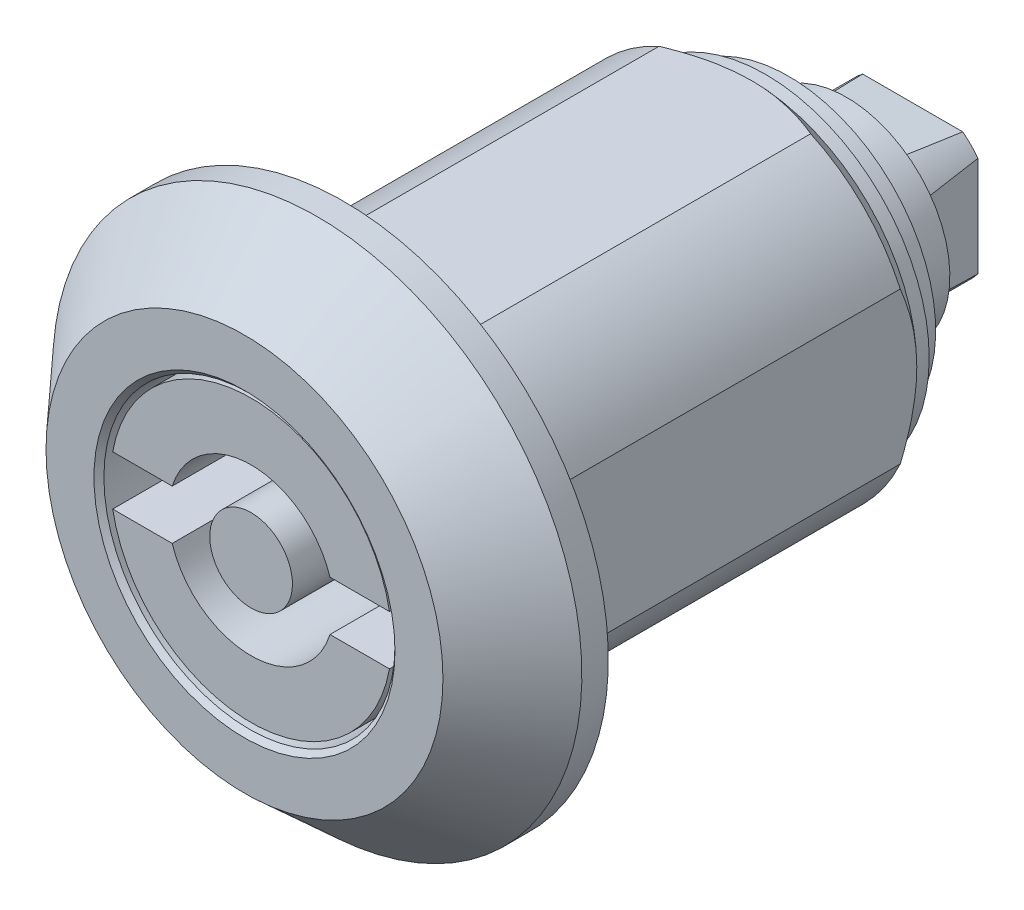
ISO-10303-21;
HEADER;
FILE_DESCRIPTION(('STEP AP214'),'2;1');
FILE_NAME('part.step','',(''),(''),'','','');
FILE_SCHEMA(('AUTOMOTIVE_DESIGN { 1 0 10303 214 1 1 1 1 }'));
ENDSEC;
DATA;
#1=APPLICATION_CONTEXT('core data for automotive mechanical design processes');
#2=APPLICATION_PROTOCOL_DEFINITION('international standard','automotive_design',2000,#1);
#3=PRODUCT_CONTEXT('',#1,'mechanical');
#4=PRODUCT('Part','Part','',(#3));
#5=PRODUCT_RELATED_PRODUCT_CATEGORY('part','',(#4));
#6=PRODUCT_DEFINITION_FORMATION('','',#4);
#7=PRODUCT_DEFINITION_CONTEXT('part definition',#1,'design');
#8=PRODUCT_DEFINITION('design','',#6,#7);
#9=PRODUCT_DEFINITION_SHAPE('','',#8);
#10=(LENGTH_UNIT() NAMED_UNIT(*) SI_UNIT(.MILLI.,.METRE.));
#11=(NAMED_UNIT(*) PLANE_ANGLE_UNIT() SI_UNIT($,.RADIAN.));
#12=(NAMED_UNIT(*) SI_UNIT($,.STERADIAN.) SOLID_ANGLE_UNIT());
#13=UNCERTAINTY_MEASURE_WITH_UNIT(LENGTH_MEASURE(1.E-05),#10,'distance_accuracy_value','');
#14=(GEOMETRIC_REPRESENTATION_CONTEXT(3) GLOBAL_UNCERTAINTY_ASSIGNED_CONTEXT((#13)) GLOBAL_UNIT_ASSIGNED_CONTEXT((#10,
#11,#12)) REPRESENTATION_CONTEXT('',''));
#15=CARTESIAN_POINT('',(0.,0.,0.));
#16=DIRECTION('',(0.,0.,1.));
#17=DIRECTION('',(1.,0.,0.));
#18=AXIS2_PLACEMENT_3D('',#15,#16,#17);
#19=CARTESIAN_POINT('',(0.,0.,-24.65));
#20=DIRECTION('',(0.,0.,-1.));
#21=DIRECTION('',(-1.,0.,0.));
#22=AXIS2_PLACEMENT_3D('',#19,#20,#21);
#23=PLANE('',#22);
#24=CARTESIAN_POINT('',(0.,0.,-24.65));
#25=DIRECTION('',(0.,0.,-1.));
#26=DIRECTION('',(-1.,0.,0.));
#27=AXIS2_PLACEMENT_3D('',#24,#25,#26);
#28=CIRCLE('',#27,9.9);
#29=CARTESIAN_POINT('',(-9.9,0.,-24.65));
#30=VERTEX_POINT('',#29);
#31=EDGE_CURVE('E1110',#30,#30,#28,.T.);
#32=ORIENTED_EDGE('',*,*,#31,.F.);
#33=EDGE_LOOP('',(#32));
#34=FACE_BOUND('',#33,.T.);
#35=CARTESIAN_POINT('',(0.,0.,-24.65));
#36=DIRECTION('',(0.,0.,1.));
#37=DIRECTION('',(1.,0.,0.));
#38=AXIS2_PLACEMENT_3D('',#35,#36,#37);
#39=CIRCLE('',#38,10.);
#40=CARTESIAN_POINT('',(-10.,0.,-24.65));
#41=VERTEX_POINT('',#40);
#42=CARTESIAN_POINT('',(0.,-10.,-24.65));
#43=VERTEX_POINT('',#42);
#44=EDGE_CURVE('E42',#41,#43,#39,.T.);
#45=ORIENTED_EDGE('',*,*,#44,.F.);
#46=CARTESIAN_POINT('',(0.,10.,-24.65));
#47=VERTEX_POINT('',#46);
#48=EDGE_CURVE('E300',#47,#41,#39,.T.);
#49=ORIENTED_EDGE('',*,*,#48,.F.);
#50=CARTESIAN_POINT('',(10.,0.,-24.65));
#51=VERTEX_POINT('',#50);
#52=EDGE_CURVE('E288',#51,#47,#39,.T.);
#53=ORIENTED_EDGE('',*,*,#52,.F.);
#54=EDGE_CURVE('E35',#43,#51,#39,.T.);
#55=ORIENTED_EDGE('',*,*,#54,.F.);
#56=EDGE_LOOP('',(#45,#49,#53,#55));
#57=FACE_BOUND('',#56,.T.);
#58=ADVANCED_FACE('F14',(#34,#57),#23,.T.);
#59=CARTESIAN_POINT('',(0.,0.,-25.5));
#60=DIRECTION('',(0.,0.,-1.));
#61=DIRECTION('',(-1.,0.,0.));
#62=AXIS2_PLACEMENT_3D('',#59,#60,#61);
#63=PLANE('',#62);
#64=CARTESIAN_POINT('',(0.,0.,-25.5));
#65=DIRECTION('',(0.,0.,-1.));
#66=DIRECTION('',(-1.,0.,0.));
#67=AXIS2_PLACEMENT_3D('',#64,#65,#66);
#68=CIRCLE('',#67,6.95);
#69=CARTESIAN_POINT('',(-6.95,0.,-25.5));
#70=VERTEX_POINT('',#69);
#71=EDGE_CURVE('E539',#70,#70,#68,.F.);
#72=ORIENTED_EDGE('',*,*,#71,.T.);
#73=EDGE_LOOP('',(#72));
#74=FACE_BOUND('',#73,.T.);
#75=CARTESIAN_POINT('',(0.,0.,-25.5));
#76=DIRECTION('',(0.,0.,-1.));
#77=DIRECTION('',(-1.,0.,0.));
#78=AXIS2_PLACEMENT_3D('',#75,#76,#77);
#79=CIRCLE('',#78,7.00000000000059);
#80=CARTESIAN_POINT('',(-3.4171322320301,-6.10927224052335,-25.5));
#81=VERTEX_POINT('',#80);
#82=CARTESIAN_POINT('',(3.4171322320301,-6.10927224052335,-25.5));
#83=VERTEX_POINT('',#82);
#84=EDGE_CURVE('E702',#81,#83,#79,.T.);
#85=ORIENTED_EDGE('',*,*,#84,.T.);
#86=DIRECTION('',(0.488161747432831,-0.872753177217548,0.));
#87=VECTOR('',#86,1.);
#88=CARTESIAN_POINT('',(4.24999999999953,-7.59830327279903,-25.5));
#89=LINE('',#88,#87);
#90=CARTESIAN_POINT('',(4.24999999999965,-7.59830327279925,-25.5));
#91=VERTEX_POINT('',#90);
#92=EDGE_CURVE('E698',#83,#91,#89,.T.);
#93=ORIENTED_EDGE('',*,*,#92,.T.);
#94=CARTESIAN_POINT('',(0.,0.21,-25.5));
#95=DIRECTION('',(0.,0.,-1.));
#96=DIRECTION('',(-1.,0.,0.));
#97=AXIS2_PLACEMENT_3D('',#94,#95,#96);
#98=CIRCLE('',#97,8.89000000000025);
#99=CARTESIAN_POINT('',(-4.24999999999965,-7.59830327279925,-25.5));
#100=VERTEX_POINT('',#99);
#101=EDGE_CURVE('E690',#91,#100,#98,.F.);
#102=ORIENTED_EDGE('',*,*,#101,.T.);
#103=DIRECTION('',(0.48816174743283,0.872753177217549,0.));
#104=VECTOR('',#103,1.);
#105=CARTESIAN_POINT('',(-4.24999999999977,-7.59830327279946,-25.5));
#106=LINE('',#105,#104);
#107=EDGE_CURVE('E705',#100,#81,#106,.T.);
#108=ORIENTED_EDGE('',*,*,#107,.T.);
#109=EDGE_LOOP('',(#85,#93,#102,#108));
#110=FACE_BOUND('',#109,.T.);
#111=CARTESIAN_POINT('',(0.,0.,-25.5));
#112=DIRECTION('',(0.,0.,-1.));
#113=DIRECTION('',(-1.,0.,0.));
#114=AXIS2_PLACEMENT_3D('',#111,#112,#113);
#115=CIRCLE('',#114,9.9);
#116=CARTESIAN_POINT('',(-9.9,0.,-25.5));
#117=VERTEX_POINT('',#116);
#118=EDGE_CURVE('E1108',#117,#117,#115,.T.);
#119=ORIENTED_EDGE('',*,*,#118,.T.);
#120=EDGE_LOOP('',(#119));
#121=FACE_BOUND('',#120,.T.);
#122=ADVANCED_FACE('F390',(#74,#110,#121),#63,.T.);
#123=CARTESIAN_POINT('',(0.85,-10.44820120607,-25.9));
#124=DIRECTION('',(0.,0.,1.));
#125=DIRECTION('',(1.,0.,0.));
#126=AXIS2_PLACEMENT_3D('',#123,#124,#125);
#127=PLANE('',#126);
#128=DIRECTION('',(0.,1.,0.));
#129=VECTOR('',#128,1.);
#130=CARTESIAN_POINT('',(0.85,-10.44820120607,-25.9));
#131=LINE('',#130,#129);
#132=CARTESIAN_POINT('',(0.85,-6.94820120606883,-25.9));
#133=VERTEX_POINT('',#132);
#134=CARTESIAN_POINT('',(0.849999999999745,-10.4482012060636,-25.9));
#135=VERTEX_POINT('',#134);
#136=EDGE_CURVE('E719',#133,#135,#131,.F.);
#137=ORIENTED_EDGE('',*,*,#136,.T.);
#138=CARTESIAN_POINT('',(0.,0.21,-25.9));
#139=DIRECTION('',(0.,0.,1.));
#140=DIRECTION('',(1.,0.,0.));
#141=AXIS2_PLACEMENT_3D('',#138,#139,#140);
#142=CIRCLE('',#141,10.69204157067);
#143=CARTESIAN_POINT('',(4.24999999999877,-9.60107807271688,-25.9));
#144=VERTEX_POINT('',#143);
#145=EDGE_CURVE('E721',#135,#144,#142,.T.);
#146=ORIENTED_EDGE('',*,*,#145,.T.);
#147=DIRECTION('',(0.,1.,0.));
#148=VECTOR('',#147,1.);
#149=CARTESIAN_POINT('',(4.25,-10.44820120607,-25.9));
#150=LINE('',#149,#148);
#151=CARTESIAN_POINT('',(4.24999999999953,-7.59830327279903,-25.9));
#152=VERTEX_POINT('',#151);
#153=EDGE_CURVE('E730',#144,#152,#150,.T.);
#154=ORIENTED_EDGE('',*,*,#153,.T.);
#155=DIRECTION('',(0.488161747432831,-0.872753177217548,0.));
#156=VECTOR('',#155,1.);
#157=CARTESIAN_POINT('',(4.65395752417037,-8.32051310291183,-25.9));
#158=LINE('',#157,#156);
#159=CARTESIAN_POINT('',(3.41713223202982,-6.10927224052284,-25.9));
#160=VERTEX_POINT('',#159);
#161=EDGE_CURVE('E793',#160,#152,#158,.T.);
#162=ORIENTED_EDGE('',*,*,#161,.F.);
#163=CARTESIAN_POINT('',(0.,0.,-25.9));
#164=DIRECTION('',(0.,0.,1.));
#165=DIRECTION('',(1.,0.,0.));
#166=AXIS2_PLACEMENT_3D('',#163,#164,#165);
#167=CIRCLE('',#166,7.);
#168=EDGE_CURVE('E725',#160,#133,#167,.F.);
#169=ORIENTED_EDGE('',*,*,#168,.T.);
#170=EDGE_LOOP('',(#137,#146,#154,#162,#169));
#171=FACE_BOUND('',#170,.T.);
#172=CARTESIAN_POINT('',(2.55,-8.114867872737,-25.9));
#173=DIRECTION('',(0.,0.,1.));
#174=DIRECTION('',(1.,0.,0.));
#175=AXIS2_PLACEMENT_3D('',#172,#173,#174);
#176=CIRCLE('',#175,0.85);
#177=CARTESIAN_POINT('',(3.4,-8.114867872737,-25.9));
#178=VERTEX_POINT('',#177);
#179=EDGE_CURVE('E774',#178,#178,#176,.F.);
#180=ORIENTED_EDGE('',*,*,#179,.T.);
#181=EDGE_LOOP('',(#180));
#182=FACE_BOUND('',#181,.T.);
#183=ADVANCED_FACE('F396',(#171,#182),#127,.T.);
#184=CARTESIAN_POINT('',(0.85,-10.44820120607,-26.9));
#185=DIRECTION('',(0.,0.,1.));
#186=DIRECTION('',(1.,0.,0.));
#187=AXIS2_PLACEMENT_3D('',#184,#185,#186);
#188=PLANE('',#187);
#189=CARTESIAN_POINT('',(-2.55,-8.114867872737,-26.9));
#190=DIRECTION('',(0.,0.,1.));
#191=DIRECTION('',(1.,0.,0.));
#192=AXIS2_PLACEMENT_3D('',#189,#190,#191);
#193=CIRCLE('',#192,0.85);
#194=CARTESIAN_POINT('',(-1.7,-8.114867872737,-26.9));
#195=VERTEX_POINT('',#194);
#196=EDGE_CURVE('E733',#195,#195,#193,.T.);
#197=ORIENTED_EDGE('',*,*,#196,.T.);
#198=EDGE_LOOP('',(#197));
#199=FACE_BOUND('',#198,.T.);
#200=DIRECTION('',(0.,1.,0.));
#201=VECTOR('',#200,1.);
#202=CARTESIAN_POINT('',(-4.25,-7.598303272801,-26.9));
#203=LINE('',#202,#201);
#204=CARTESIAN_POINT('',(-4.25,-7.59830327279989,-26.9));
#205=VERTEX_POINT('',#204);
#206=CARTESIAN_POINT('',(-4.24999999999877,-9.60107807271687,-26.9));
#207=VERTEX_POINT('',#206);
#208=EDGE_CURVE('E757',#205,#207,#203,.F.);
#209=ORIENTED_EDGE('',*,*,#208,.F.);
#210=CARTESIAN_POINT('',(0.,0.21,-26.9));
#211=DIRECTION('',(0.,0.,1.));
#212=DIRECTION('',(1.,0.,0.));
#213=AXIS2_PLACEMENT_3D('',#210,#211,#212);
#214=CIRCLE('',#213,8.89);
#215=CARTESIAN_POINT('',(4.24999999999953,-7.59830327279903,-26.9));
#216=VERTEX_POINT('',#215);
#217=EDGE_CURVE('E761',#216,#205,#214,.T.);
#218=ORIENTED_EDGE('',*,*,#217,.F.);
#219=DIRECTION('',(0.,1.,0.));
#220=VECTOR('',#219,1.);
#221=CARTESIAN_POINT('',(4.25,-9.6010780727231,-26.9));
#222=LINE('',#221,#220);
#223=CARTESIAN_POINT('',(4.24999999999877,-9.60107807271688,-26.9));
#224=VERTEX_POINT('',#223);
#225=EDGE_CURVE('E718',#224,#216,#222,.T.);
#226=ORIENTED_EDGE('',*,*,#225,.F.);
#227=CARTESIAN_POINT('',(0.,0.21,-26.9));
#228=DIRECTION('',(0.,0.,1.));
#229=DIRECTION('',(1.,0.,0.));
#230=AXIS2_PLACEMENT_3D('',#227,#228,#229);
#231=CIRCLE('',#230,10.69204157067);
#232=CARTESIAN_POINT('',(0.849999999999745,-10.4482012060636,-26.9));
#233=VERTEX_POINT('',#232);
#234=EDGE_CURVE('E741',#233,#224,#231,.T.);
#235=ORIENTED_EDGE('',*,*,#234,.F.);
#236=DIRECTION('',(0.,1.,0.));
#237=VECTOR('',#236,1.);
#238=CARTESIAN_POINT('',(0.85,-6.94820120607,-26.9));
#239=LINE('',#238,#237);
#240=CARTESIAN_POINT('',(0.85,-6.94820120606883,-26.9));
#241=VERTEX_POINT('',#240);
#242=EDGE_CURVE('E738',#241,#233,#239,.F.);
#243=ORIENTED_EDGE('',*,*,#242,.F.);
#244=CARTESIAN_POINT('',(0.,0.,-26.9));
#245=DIRECTION('',(0.,0.,1.));
#246=DIRECTION('',(1.,0.,0.));
#247=AXIS2_PLACEMENT_3D('',#244,#245,#246);
#248=CIRCLE('',#247,7.);
#249=CARTESIAN_POINT('',(-0.849999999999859,-6.94820120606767,-26.9));
#250=VERTEX_POINT('',#249);
#251=EDGE_CURVE('E748',#241,#250,#248,.T.);
#252=ORIENTED_EDGE('',*,*,#251,.T.);
#253=DIRECTION('',(0.,1.,0.));
#254=VECTOR('',#253,1.);
#255=CARTESIAN_POINT('',(-0.85,-10.44820120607,-26.9));
#256=LINE('',#255,#254);
#257=CARTESIAN_POINT('',(-0.85,-10.4482012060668,-26.9));
#258=VERTEX_POINT('',#257);
#259=EDGE_CURVE('E752',#258,#250,#256,.T.);
#260=ORIENTED_EDGE('',*,*,#259,.F.);
#261=CARTESIAN_POINT('',(0.,0.21,-26.9));
#262=DIRECTION('',(0.,0.,1.));
#263=DIRECTION('',(1.,0.,0.));
#264=AXIS2_PLACEMENT_3D('',#261,#262,#263);
#265=CIRCLE('',#264,10.69204157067);
#266=EDGE_CURVE('E753',#207,#258,#265,.T.);
#267=ORIENTED_EDGE('',*,*,#266,.F.);
#268=EDGE_LOOP('',(#209,#218,#226,#235,#243,#252,#260,#267));
#269=FACE_BOUND('',#268,.T.);
#270=CARTESIAN_POINT('',(2.55,-8.114867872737,-26.9));
#271=DIRECTION('',(0.,0.,1.));
#272=DIRECTION('',(1.,0.,0.));
#273=AXIS2_PLACEMENT_3D('',#270,#271,#272);
#274=CIRCLE('',#273,0.85);
#275=CARTESIAN_POINT('',(3.4,-8.114867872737,-26.9));
#276=VERTEX_POINT('',#275);
#277=EDGE_CURVE('E784',#276,#276,#274,.T.);
#278=ORIENTED_EDGE('',*,*,#277,.T.);
#279=EDGE_LOOP('',(#278));
#280=FACE_BOUND('',#279,.T.);
#281=ADVANCED_FACE('F16',(#199,#269,#280),#188,.F.);
#282=CARTESIAN_POINT('',(4.25,-9.6010780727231,-26.9));
#283=DIRECTION('',(1.,0.,0.));
#284=DIRECTION('',(0.,0.,-1.));
#285=AXIS2_PLACEMENT_3D('',#282,#283,#284);
#286=PLANE('',#285);
#287=DIRECTION('',(0.,0.,1.));
#288=VECTOR('',#287,1.);
#289=CARTESIAN_POINT('',(4.24999999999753,-9.60107807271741,-26.9));
#290=LINE('',#289,#288);
#291=EDGE_CURVE('E734',#224,#144,#290,.T.);
#292=ORIENTED_EDGE('',*,*,#291,.F.);
#293=ORIENTED_EDGE('',*,*,#225,.T.);
#294=DIRECTION('',(0.,0.,1.));
#295=VECTOR('',#294,1.);
#296=CARTESIAN_POINT('',(4.24999999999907,-7.59830327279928,-26.9));
#297=LINE('',#296,#295);
#298=EDGE_CURVE('E762',#152,#216,#297,.F.);
#299=ORIENTED_EDGE('',*,*,#298,.F.);
#300=ORIENTED_EDGE('',*,*,#153,.F.);
#301=EDGE_LOOP('',(#292,#293,#299,#300));
#302=FACE_BOUND('',#301,.T.);
#303=ADVANCED_FACE('F1066',(#302),#286,.T.);
#304=CARTESIAN_POINT('',(0.,0.21,-26.9));
#305=DIRECTION('',(0.,0.,1.));
#306=DIRECTION('',(1.,0.,0.));
#307=AXIS2_PLACEMENT_3D('',#304,#305,#306);
#308=CYLINDRICAL_SURFACE('',#307,8.89);
#309=ORIENTED_EDGE('',*,*,#298,.T.);
#310=ORIENTED_EDGE('',*,*,#217,.T.);
#311=DIRECTION('',(0.,0.,1.));
#312=VECTOR('',#311,1.);
#313=CARTESIAN_POINT('',(-4.25,-7.598303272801,-26.9));
#314=LINE('',#313,#312);
#315=CARTESIAN_POINT('',(-4.25,-7.59830327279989,-25.9));
#316=VERTEX_POINT('',#315);
#317=EDGE_CURVE('E758',#316,#205,#314,.F.);
#318=ORIENTED_EDGE('',*,*,#317,.F.);
#319=DIRECTION('',(0.,0.,-1.));
#320=VECTOR('',#319,1.);
#321=CARTESIAN_POINT('',(-4.24999999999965,-7.59830327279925,-1.10816259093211));
#322=LINE('',#321,#320);
#323=EDGE_CURVE('E711',#100,#316,#322,.T.);
#324=ORIENTED_EDGE('',*,*,#323,.F.);
#325=ORIENTED_EDGE('',*,*,#101,.F.);
#326=DIRECTION('',(0.,0.,-1.));
#327=VECTOR('',#326,1.);
#328=CARTESIAN_POINT('',(4.24999999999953,-7.59830327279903,-1.10816259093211));
#329=LINE('',#328,#327);
#330=EDGE_CURVE('E708',#91,#152,#329,.T.);
#331=ORIENTED_EDGE('',*,*,#330,.T.);
#332=EDGE_LOOP('',(#309,#310,#318,#324,#325,#331));
#333=FACE_BOUND('',#332,.T.);
#334=ADVANCED_FACE('F1063',(#333),#308,.T.);
#335=CARTESIAN_POINT('',(-4.25,-7.598303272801,-26.9));
#336=DIRECTION('',(-1.,0.,0.));
#337=DIRECTION('',(0.,0.,1.));
#338=AXIS2_PLACEMENT_3D('',#335,#336,#337);
#339=PLANE('',#338);
#340=ORIENTED_EDGE('',*,*,#317,.T.);
#341=ORIENTED_EDGE('',*,*,#208,.T.);
#342=DIRECTION('',(0.,0.,1.));
#343=VECTOR('',#342,1.);
#344=CARTESIAN_POINT('',(-4.24999999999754,-9.60107807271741,-26.9));
#345=LINE('',#344,#343);
#346=CARTESIAN_POINT('',(-4.24999999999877,-9.60107807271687,-25.9));
#347=VERTEX_POINT('',#346);
#348=EDGE_CURVE('E754',#347,#207,#345,.F.);
#349=ORIENTED_EDGE('',*,*,#348,.F.);
#350=DIRECTION('',(0.,1.,0.));
#351=VECTOR('',#350,1.);
#352=CARTESIAN_POINT('',(-4.25,-10.44820120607,-25.9));
#353=LINE('',#352,#351);
#354=EDGE_CURVE('E727',#316,#347,#353,.F.);
#355=ORIENTED_EDGE('',*,*,#354,.F.);
#356=EDGE_LOOP('',(#340,#341,#349,#355));
#357=FACE_BOUND('',#356,.T.);
#358=ADVANCED_FACE('F1059',(#357),#339,.T.);
#359=CARTESIAN_POINT('',(0.,0.21,-26.9));
#360=DIRECTION('',(0.,0.,1.));
#361=DIRECTION('',(1.,0.,0.));
#362=AXIS2_PLACEMENT_3D('',#359,#360,#361);
#363=CYLINDRICAL_SURFACE('',#362,10.69204157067);
#364=ORIENTED_EDGE('',*,*,#348,.T.);
#365=ORIENTED_EDGE('',*,*,#266,.T.);
#366=DIRECTION('',(0.,0.,-1.));
#367=VECTOR('',#366,1.);
#368=CARTESIAN_POINT('',(-0.85,-10.44820120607,-26.9));
#369=LINE('',#368,#367);
#370=CARTESIAN_POINT('',(-0.85,-10.4482012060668,-25.9));
#371=VERTEX_POINT('',#370);
#372=EDGE_CURVE('E749',#371,#258,#369,.T.);
#373=ORIENTED_EDGE('',*,*,#372,.F.);
#374=CARTESIAN_POINT('',(0.,0.21,-25.9));
#375=DIRECTION('',(0.,0.,1.));
#376=DIRECTION('',(1.,0.,0.));
#377=AXIS2_PLACEMENT_3D('',#374,#375,#376);
#378=CIRCLE('',#377,10.69204157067);
#379=EDGE_CURVE('E726',#347,#371,#378,.T.);
#380=ORIENTED_EDGE('',*,*,#379,.F.);
#381=EDGE_LOOP('',(#364,#365,#373,#380));
#382=FACE_BOUND('',#381,.T.);
#383=ADVANCED_FACE('F1055',(#382),#363,.T.);
#384=CARTESIAN_POINT('',(-0.85,-10.44820120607,-26.9));
#385=DIRECTION('',(1.,0.,0.));
#386=DIRECTION('',(0.,0.,-1.));
#387=AXIS2_PLACEMENT_3D('',#384,#385,#386);
#388=PLANE('',#387);
#389=ORIENTED_EDGE('',*,*,#372,.T.);
#390=ORIENTED_EDGE('',*,*,#259,.T.);
#391=DIRECTION('',(0.,0.,1.));
#392=VECTOR('',#391,1.);
#393=CARTESIAN_POINT('',(-0.849999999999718,-6.94820120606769,-26.9));
#394=LINE('',#393,#392);
#395=CARTESIAN_POINT('',(-0.849999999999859,-6.94820120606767,-25.9));
#396=VERTEX_POINT('',#395);
#397=EDGE_CURVE('E745',#250,#396,#394,.T.);
#398=ORIENTED_EDGE('',*,*,#397,.T.);
#399=DIRECTION('',(0.,1.,0.));
#400=VECTOR('',#399,1.);
#401=CARTESIAN_POINT('',(-0.85,-10.44820120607,-25.9));
#402=LINE('',#401,#400);
#403=EDGE_CURVE('E723',#371,#396,#402,.T.);
#404=ORIENTED_EDGE('',*,*,#403,.F.);
#405=EDGE_LOOP('',(#389,#390,#398,#404));
#406=FACE_BOUND('',#405,.T.);
#407=ADVANCED_FACE('F1051',(#406),#388,.T.);
#408=CARTESIAN_POINT('',(0.,0.,-26.9));
#409=DIRECTION('',(0.,0.,1.));
#410=DIRECTION('',(1.,0.,0.));
#411=AXIS2_PLACEMENT_3D('',#408,#409,#410);
#412=CYLINDRICAL_SURFACE('',#411,7.);
#413=ORIENTED_EDGE('',*,*,#397,.F.);
#414=ORIENTED_EDGE('',*,*,#251,.F.);
#415=DIRECTION('',(0.,0.,1.));
#416=VECTOR('',#415,1.);
#417=CARTESIAN_POINT('',(0.85,-6.94820120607,-26.9));
#418=LINE('',#417,#416);
#419=EDGE_CURVE('E742',#133,#241,#418,.F.);
#420=ORIENTED_EDGE('',*,*,#419,.F.);
#421=ORIENTED_EDGE('',*,*,#168,.F.);
#422=DIRECTION('',(0.,0.,-1.));
#423=VECTOR('',#422,1.);
#424=CARTESIAN_POINT('',(3.4171322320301,-6.10927224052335,-1.10816259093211));
#425=LINE('',#424,#423);
#426=EDGE_CURVE('E699',#83,#160,#425,.T.);
#427=ORIENTED_EDGE('',*,*,#426,.F.);
#428=ORIENTED_EDGE('',*,*,#84,.F.);
#429=DIRECTION('',(0.,0.,-1.));
#430=VECTOR('',#429,1.);
#431=CARTESIAN_POINT('',(-3.4171322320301,-6.10927224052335,-1.10816259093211));
#432=LINE('',#431,#430);
#433=CARTESIAN_POINT('',(-3.4171322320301,-6.10927224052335,-25.9));
#434=VERTEX_POINT('',#433);
#435=EDGE_CURVE('E439',#81,#434,#432,.T.);
#436=ORIENTED_EDGE('',*,*,#435,.T.);
#437=EDGE_CURVE('E722',#396,#434,#167,.F.);
#438=ORIENTED_EDGE('',*,*,#437,.F.);
#439=EDGE_LOOP('',(#413,#414,#420,#421,#427,#428,#436,#438));
#440=FACE_BOUND('',#439,.T.);
#441=ADVANCED_FACE('F1047',(#440),#412,.F.);
#442=CARTESIAN_POINT('',(0.85,-6.94820120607,-26.9));
#443=DIRECTION('',(-1.,0.,0.));
#444=DIRECTION('',(0.,0.,1.));
#445=AXIS2_PLACEMENT_3D('',#442,#443,#444);
#446=PLANE('',#445);
#447=ORIENTED_EDGE('',*,*,#419,.T.);
#448=ORIENTED_EDGE('',*,*,#242,.T.);
#449=DIRECTION('',(0.,0.,1.));
#450=VECTOR('',#449,1.);
#451=CARTESIAN_POINT('',(0.84999999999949,-10.4482012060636,-26.9));
#452=LINE('',#451,#450);
#453=EDGE_CURVE('E737',#135,#233,#452,.F.);
#454=ORIENTED_EDGE('',*,*,#453,.F.);
#455=ORIENTED_EDGE('',*,*,#136,.F.);
#456=EDGE_LOOP('',(#447,#448,#454,#455));
#457=FACE_BOUND('',#456,.T.);
#458=ADVANCED_FACE('F1043',(#457),#446,.T.);
#459=CARTESIAN_POINT('',(0.,0.21,-26.9));
#460=DIRECTION('',(0.,0.,1.));
#461=DIRECTION('',(1.,0.,0.));
#462=AXIS2_PLACEMENT_3D('',#459,#460,#461);
#463=CYLINDRICAL_SURFACE('',#462,10.69204157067);
#464=ORIENTED_EDGE('',*,*,#453,.T.);
#465=ORIENTED_EDGE('',*,*,#234,.T.);
#466=ORIENTED_EDGE('',*,*,#291,.T.);
#467=ORIENTED_EDGE('',*,*,#145,.F.);
#468=EDGE_LOOP('',(#464,#465,#466,#467));
#469=FACE_BOUND('',#468,.T.);
#470=ADVANCED_FACE('F1039',(#469),#463,.T.);
#471=CARTESIAN_POINT('',(2.55,-8.114867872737,-27.));
#472=DIRECTION('',(0.,0.,1.));
#473=DIRECTION('',(1.,0.,0.));
#474=AXIS2_PLACEMENT_3D('',#471,#472,#473);
#475=CYLINDRICAL_SURFACE('',#474,0.85);
#476=ORIENTED_EDGE('',*,*,#179,.F.);
#477=EDGE_LOOP('',(#476));
#478=FACE_BOUND('',#477,.T.);
#479=ORIENTED_EDGE('',*,*,#277,.F.);
#480=EDGE_LOOP('',(#479));
#481=FACE_BOUND('',#480,.T.);
#482=ADVANCED_FACE('F1035',(#478,#481),#475,.F.);
#483=CARTESIAN_POINT('',(-2.55,-8.114867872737,-27.));
#484=DIRECTION('',(0.,0.,1.));
#485=DIRECTION('',(1.,0.,0.));
#486=AXIS2_PLACEMENT_3D('',#483,#484,#485);
#487=CYLINDRICAL_SURFACE('',#486,0.85);
#488=CARTESIAN_POINT('',(-2.55,-8.114867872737,-25.9));
#489=DIRECTION('',(0.,0.,1.));
#490=DIRECTION('',(1.,0.,0.));
#491=AXIS2_PLACEMENT_3D('',#488,#489,#490);
#492=CIRCLE('',#491,0.85);
#493=CARTESIAN_POINT('',(-1.7,-8.114867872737,-25.9));
#494=VERTEX_POINT('',#493);
#495=EDGE_CURVE('E770',#494,#494,#492,.F.);
#496=ORIENTED_EDGE('',*,*,#495,.F.);
#497=EDGE_LOOP('',(#496));
#498=FACE_BOUND('',#497,.T.);
#499=ORIENTED_EDGE('',*,*,#196,.F.);
#500=EDGE_LOOP('',(#499));
#501=FACE_BOUND('',#500,.T.);
#502=ADVANCED_FACE('F1031',(#498,#501),#487,.F.);
#503=ORIENTED_EDGE('',*,*,#403,.T.);
#504=ORIENTED_EDGE('',*,*,#437,.T.);
#505=DIRECTION('',(0.48816174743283,0.872753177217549,0.));
#506=VECTOR('',#505,1.);
#507=CARTESIAN_POINT('',(-4.24884430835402,-7.59623708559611,-25.9));
#508=LINE('',#507,#506);
#509=EDGE_CURVE('E773',#316,#434,#508,.T.);
#510=ORIENTED_EDGE('',*,*,#509,.F.);
#511=ORIENTED_EDGE('',*,*,#354,.T.);
#512=ORIENTED_EDGE('',*,*,#379,.T.);
#513=EDGE_LOOP('',(#503,#504,#510,#511,#512));
#514=FACE_BOUND('',#513,.T.);
#515=ORIENTED_EDGE('',*,*,#495,.T.);
#516=EDGE_LOOP('',(#515));
#517=FACE_BOUND('',#516,.T.);
#518=ADVANCED_FACE('F1025',(#514,#517),#127,.T.);
#519=CARTESIAN_POINT('',(4.24999999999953,-7.59830327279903,-1.10816259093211));
#520=DIRECTION('',(-0.872753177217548,-0.488161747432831,0.));
#521=DIRECTION('',(-0.488161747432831,0.872753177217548,0.));
#522=AXIS2_PLACEMENT_3D('',#519,#520,#521);
#523=PLANE('',#522);
#524=ORIENTED_EDGE('',*,*,#426,.T.);
#525=ORIENTED_EDGE('',*,*,#161,.T.);
#526=ORIENTED_EDGE('',*,*,#330,.F.);
#527=ORIENTED_EDGE('',*,*,#92,.F.);
#528=EDGE_LOOP('',(#524,#525,#526,#527));
#529=FACE_BOUND('',#528,.T.);
#530=ADVANCED_FACE('F1022',(#529),#523,.T.);
#531=CARTESIAN_POINT('',(-4.24999999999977,-7.59830327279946,-1.10816259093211));
#532=DIRECTION('',(0.872753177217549,-0.48816174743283,0.));
#533=DIRECTION('',(-0.48816174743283,-0.872753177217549,0.));
#534=AXIS2_PLACEMENT_3D('',#531,#532,#533);
#535=PLANE('',#534);
#536=ORIENTED_EDGE('',*,*,#323,.T.);
#537=ORIENTED_EDGE('',*,*,#509,.T.);
#538=ORIENTED_EDGE('',*,*,#435,.F.);
#539=ORIENTED_EDGE('',*,*,#107,.F.);
#540=EDGE_LOOP('',(#536,#537,#538,#539));
#541=FACE_BOUND('',#540,.T.);
#542=ADVANCED_FACE('F999',(#541),#535,.T.);
#543=CARTESIAN_POINT('',(0.,0.,7.4));
#544=DIRECTION('',(0.,0.,-1.));
#545=DIRECTION('',(0.,-1.,0.));
#546=AXIS2_PLACEMENT_3D('',#543,#544,#545);
#547=CYLINDRICAL_SURFACE('',#546,6.95);
#548=CARTESIAN_POINT('',(0.,0.,-28.));
#549=DIRECTION('',(0.,0.,-1.));
#550=DIRECTION('',(0.,-1.,0.));
#551=AXIS2_PLACEMENT_3D('',#548,#549,#550);
#552=CIRCLE('',#551,6.95);
#553=CARTESIAN_POINT('',(0.,-6.95,-28.));
#554=VERTEX_POINT('',#553);
#555=EDGE_CURVE('E577',#554,#554,#552,.F.);
#556=ORIENTED_EDGE('',*,*,#555,.T.);
#557=EDGE_LOOP('',(#556));
#558=FACE_BOUND('',#557,.T.);
#559=CARTESIAN_POINT('',(0.,0.,-27.));
#560=DIRECTION('',(0.,0.,-1.));
#561=DIRECTION('',(0.,-1.,0.));
#562=AXIS2_PLACEMENT_3D('',#559,#560,#561);
#563=CIRCLE('',#562,6.95);
#564=CARTESIAN_POINT('',(0.,-6.95,-27.));
#565=VERTEX_POINT('',#564);
#566=EDGE_CURVE('E583',#565,#565,#563,.T.);
#567=ORIENTED_EDGE('',*,*,#566,.T.);
#568=EDGE_LOOP('',(#567));
#569=FACE_BOUND('',#568,.T.);
#570=ADVANCED_FACE('F995',(#558,#569),#547,.T.);
#571=CARTESIAN_POINT('',(0.,0.,-27.));
#572=DIRECTION('',(0.,0.,-1.));
#573=DIRECTION('',(0.,-1.,0.));
#574=AXIS2_PLACEMENT_3D('',#571,#572,#573);
#575=PLANE('',#574);
#576=CARTESIAN_POINT('',(0.,0.,-27.));
#577=DIRECTION('',(0.,0.,-1.));
#578=DIRECTION('',(0.,-1.,0.));
#579=AXIS2_PLACEMENT_3D('',#576,#577,#578);
#580=CIRCLE('',#579,6.6);
#581=CARTESIAN_POINT('',(0.,-6.6,-27.));
#582=VERTEX_POINT('',#581);
#583=EDGE_CURVE('E589',#582,#582,#580,.F.);
#584=ORIENTED_EDGE('',*,*,#583,.F.);
#585=EDGE_LOOP('',(#584));
#586=FACE_BOUND('',#585,.T.);
#587=ORIENTED_EDGE('',*,*,#566,.F.);
#588=EDGE_LOOP('',(#587));
#589=FACE_BOUND('',#588,.T.);
#590=ADVANCED_FACE('F998',(#586,#589),#575,.F.);
#591=CARTESIAN_POINT('',(0.,0.,7.4));
#592=DIRECTION('',(0.,0.,-1.));
#593=DIRECTION('',(0.,-1.,0.));
#594=AXIS2_PLACEMENT_3D('',#591,#592,#593);
#595=CYLINDRICAL_SURFACE('',#594,6.6);
#596=CARTESIAN_POINT('',(0.,0.,-25.9));
#597=DIRECTION('',(0.,0.,-1.));
#598=DIRECTION('',(0.,-1.,0.));
#599=AXIS2_PLACEMENT_3D('',#596,#597,#598);
#600=CIRCLE('',#599,6.6);
#601=CARTESIAN_POINT('',(0.,-6.6,-25.9));
#602=VERTEX_POINT('',#601);
#603=EDGE_CURVE('E592',#602,#602,#600,.F.);
#604=ORIENTED_EDGE('',*,*,#603,.F.);
#605=EDGE_LOOP('',(#604));
#606=FACE_BOUND('',#605,.T.);
#607=ORIENTED_EDGE('',*,*,#583,.T.);
#608=EDGE_LOOP('',(#607));
#609=FACE_BOUND('',#608,.T.);
#610=ADVANCED_FACE('F1007',(#606,#609),#595,.T.);
#611=CARTESIAN_POINT('',(0.,0.,-25.9));
#612=DIRECTION('',(0.,0.,-1.));
#613=DIRECTION('',(0.,-1.,0.));
#614=AXIS2_PLACEMENT_3D('',#611,#612,#613);
#615=PLANE('',#614);
#616=ORIENTED_EDGE('',*,*,#603,.T.);
#617=EDGE_LOOP('',(#616));
#618=FACE_BOUND('',#617,.T.);
#619=CARTESIAN_POINT('',(0.,0.,-25.9));
#620=DIRECTION('',(0.,0.,-1.));
#621=DIRECTION('',(0.,-1.,0.));
#622=AXIS2_PLACEMENT_3D('',#619,#620,#621);
#623=CIRCLE('',#622,6.95);
#624=CARTESIAN_POINT('',(0.,-6.95,-25.9));
#625=VERTEX_POINT('',#624);
#626=EDGE_CURVE('E542',#625,#625,#623,.F.);
#627=ORIENTED_EDGE('',*,*,#626,.F.);
#628=EDGE_LOOP('',(#627));
#629=FACE_BOUND('',#628,.T.);
#630=ADVANCED_FACE('F1014',(#618,#629),#615,.T.);
#631=CARTESIAN_POINT('',(0.,0.,7.4));
#632=DIRECTION('',(0.,0.,-1.));
#633=DIRECTION('',(0.,-1.,0.));
#634=AXIS2_PLACEMENT_3D('',#631,#632,#633);
#635=CYLINDRICAL_SURFACE('',#634,6.95);
#636=ORIENTED_EDGE('',*,*,#71,.F.);
#637=EDGE_LOOP('',(#636));
#638=FACE_BOUND('',#637,.T.);
#639=ORIENTED_EDGE('',*,*,#626,.T.);
#640=EDGE_LOOP('',(#639));
#641=FACE_BOUND('',#640,.T.);
#642=ADVANCED_FACE('F989',(#638,#641),#635,.T.);
#643=CARTESIAN_POINT('',(0.,0.,-28.));
#644=DIRECTION('',(0.,0.,-1.));
#645=DIRECTION('',(0.,-1.,0.));
#646=AXIS2_PLACEMENT_3D('',#643,#644,#645);
#647=PLANE('',#646);
#648=CARTESIAN_POINT('',(0.,0.,-28.));
#649=DIRECTION('',(0.,0.,-1.));
#650=DIRECTION('',(0.,-1.,0.));
#651=AXIS2_PLACEMENT_3D('',#648,#649,#650);
#652=CIRCLE('',#651,6.25);
#653=CARTESIAN_POINT('',(0.,-6.25,-28.));
#654=VERTEX_POINT('',#653);
#655=EDGE_CURVE('E574',#654,#654,#652,.T.);
#656=ORIENTED_EDGE('',*,*,#655,.F.);
#657=EDGE_LOOP('',(#656));
#658=FACE_BOUND('',#657,.T.);
#659=ORIENTED_EDGE('',*,*,#555,.F.);
#660=EDGE_LOOP('',(#659));
#661=FACE_BOUND('',#660,.T.);
#662=ADVANCED_FACE('F985',(#658,#661),#647,.T.);
#663=CARTESIAN_POINT('',(0.,0.,7.4));
#664=DIRECTION('',(0.,0.,-1.));
#665=DIRECTION('',(0.,-1.,0.));
#666=AXIS2_PLACEMENT_3D('',#663,#664,#665);
#667=CYLINDRICAL_SURFACE('',#666,6.25);
#668=CARTESIAN_POINT('',(0.,0.,-30.4));
#669=DIRECTION('',(0.,0.,-1.));
#670=DIRECTION('',(0.,-1.,0.));
#671=AXIS2_PLACEMENT_3D('',#668,#669,#670);
#672=CIRCLE('',#671,6.25);
#673=CARTESIAN_POINT('',(0.,-6.25,-30.4));
#674=VERTEX_POINT('',#673);
#675=EDGE_CURVE('E580',#674,#674,#672,.T.);
#676=ORIENTED_EDGE('',*,*,#675,.F.);
#677=EDGE_LOOP('',(#676));
#678=FACE_BOUND('',#677,.T.);
#679=ORIENTED_EDGE('',*,*,#655,.T.);
#680=EDGE_LOOP('',(#679));
#681=FACE_BOUND('',#680,.T.);
#682=ADVANCED_FACE('F988',(#678,#681),#667,.T.);
#683=CARTESIAN_POINT('',(0.,0.,-30.4));
#684=DIRECTION('',(0.,0.,-1.));
#685=DIRECTION('',(0.,-1.,0.));
#686=AXIS2_PLACEMENT_3D('',#683,#684,#685);
#687=PLANE('',#686);
#688=CARTESIAN_POINT('',(0.,0.,-30.4));
#689=DIRECTION('',(0.,0.,-1.));
#690=DIRECTION('',(0.,-1.,0.));
#691=AXIS2_PLACEMENT_3D('',#688,#689,#690);
#692=CIRCLE('',#691,5.);
#693=CARTESIAN_POINT('',(0.,-5.,-30.4));
#694=VERTEX_POINT('',#693);
#695=EDGE_CURVE('E586',#694,#694,#692,.F.);
#696=ORIENTED_EDGE('',*,*,#695,.T.);
#697=EDGE_LOOP('',(#696));
#698=FACE_BOUND('',#697,.T.);
#699=ORIENTED_EDGE('',*,*,#675,.T.);
#700=EDGE_LOOP('',(#699));
#701=FACE_BOUND('',#700,.T.);
#702=ADVANCED_FACE('F993',(#698,#701),#687,.T.);
#703=CARTESIAN_POINT('',(0.,0.,-30.4));
#704=DIRECTION('',(0.,0.,-1.));
#705=DIRECTION('',(0.,-1.,0.));
#706=AXIS2_PLACEMENT_3D('',#703,#704,#705);
#707=CYLINDRICAL_SURFACE('',#706,5.);
#708=CARTESIAN_POINT('',(0.,0.,-25.5));
#709=DIRECTION('',(0.,0.,-1.));
#710=DIRECTION('',(-1.,0.,0.));
#711=AXIS2_PLACEMENT_3D('',#708,#709,#710);
#712=CIRCLE('',#711,5.);
#713=CARTESIAN_POINT('',(-5.,0.,-25.5));
#714=VERTEX_POINT('',#713);
#715=EDGE_CURVE('E537',#714,#714,#712,.F.);
#716=ORIENTED_EDGE('',*,*,#715,.T.);
#717=EDGE_LOOP('',(#716));
#718=FACE_BOUND('',#717,.T.);
#719=ORIENTED_EDGE('',*,*,#695,.F.);
#720=EDGE_LOOP('',(#719));
#721=FACE_BOUND('',#720,.T.);
#722=ADVANCED_FACE('F1003',(#718,#721),#707,.F.);
#723=CARTESIAN_POINT('',(0.,0.,-25.5));
#724=DIRECTION('',(0.,0.,-1.));
#725=DIRECTION('',(-1.,0.,0.));
#726=AXIS2_PLACEMENT_3D('',#723,#724,#725);
#727=CIRCLE('',#726,2.5);
#728=CARTESIAN_POINT('',(-2.5,0.,-25.5));
#729=VERTEX_POINT('',#728);
#730=EDGE_CURVE('E546',#729,#729,#727,.F.);
#731=ORIENTED_EDGE('',*,*,#730,.F.);
#732=EDGE_LOOP('',(#731));
#733=FACE_BOUND('',#732,.T.);
#734=ADVANCED_FACE('F400',(#733),#63,.T.);
#735=CARTESIAN_POINT('',(0.,0.,-34.4));
#736=DIRECTION('',(0.,0.,-1.));
#737=DIRECTION('',(0.,-1.,0.));
#738=AXIS2_PLACEMENT_3D('',#735,#736,#737);
#739=CYLINDRICAL_SURFACE('',#738,2.5);
#740=CARTESIAN_POINT('',(0.,0.,-33.4));
#741=DIRECTION('',(0.,0.,-1.));
#742=DIRECTION('',(0.,-1.,0.));
#743=AXIS2_PLACEMENT_3D('',#740,#741,#742);
#744=CIRCLE('',#743,2.5);
#745=CARTESIAN_POINT('',(0.,-2.5,-33.4));
#746=VERTEX_POINT('',#745);
#747=EDGE_CURVE('E435',#746,#746,#744,.F.);
#748=ORIENTED_EDGE('',*,*,#747,.F.);
#749=EDGE_LOOP('',(#748));
#750=FACE_BOUND('',#749,.T.);
#751=ORIENTED_EDGE('',*,*,#730,.T.);
#752=EDGE_LOOP('',(#751));
#753=FACE_BOUND('',#752,.T.);
#754=ADVANCED_FACE('F881',(#750,#753),#739,.F.);
#755=CARTESIAN_POINT('',(0.,0.,-33.4));
#756=DIRECTION('',(0.,0.,-1.));
#757=DIRECTION('',(0.,-1.,0.));
#758=AXIS2_PLACEMENT_3D('',#755,#756,#757);
#759=PLANE('',#758);
#760=ORIENTED_EDGE('',*,*,#747,.T.);
#761=EDGE_LOOP('',(#760));
#762=FACE_BOUND('',#761,.T.);
#763=CARTESIAN_POINT('',(0.,0.,-33.4));
#764=DIRECTION('',(0.,0.,-1.));
#765=DIRECTION('',(0.,-1.,0.));
#766=AXIS2_PLACEMENT_3D('',#763,#764,#765);
#767=CIRCLE('',#766,3.05);
#768=CARTESIAN_POINT('',(0.,-3.05,-33.4));
#769=VERTEX_POINT('',#768);
#770=EDGE_CURVE('E447',#769,#769,#767,.T.);
#771=ORIENTED_EDGE('',*,*,#770,.T.);
#772=EDGE_LOOP('',(#771));
#773=FACE_BOUND('',#772,.T.);
#774=ADVANCED_FACE('F884',(#762,#773),#759,.T.);
#775=CARTESIAN_POINT('',(0.,0.,-34.4));
#776=DIRECTION('',(0.,0.,-1.));
#777=DIRECTION('',(0.,-1.,0.));
#778=AXIS2_PLACEMENT_3D('',#775,#776,#777);
#779=CYLINDRICAL_SURFACE('',#778,3.05);
#780=CARTESIAN_POINT('',(0.,0.,-34.4));
#781=DIRECTION('',(0.,0.,-1.));
#782=DIRECTION('',(0.,-1.,0.));
#783=AXIS2_PLACEMENT_3D('',#780,#781,#782);
#784=CIRCLE('',#783,3.05);
#785=CARTESIAN_POINT('',(0.,-3.05,-34.4));
#786=VERTEX_POINT('',#785);
#787=EDGE_CURVE('E456',#786,#786,#784,.F.);
#788=ORIENTED_EDGE('',*,*,#787,.F.);
#789=EDGE_LOOP('',(#788));
#790=FACE_BOUND('',#789,.T.);
#791=ORIENTED_EDGE('',*,*,#770,.F.);
#792=EDGE_LOOP('',(#791));
#793=FACE_BOUND('',#792,.T.);
#794=ADVANCED_FACE('F888',(#790,#793),#779,.F.);
#795=CARTESIAN_POINT('',(4.2,5.97,-30.7));
#796=DIRECTION('',(0.,0.,1.));
#797=DIRECTION('',(0.,1.,0.));
#798=AXIS2_PLACEMENT_3D('',#795,#796,#797);
#799=PLANE('',#798);
#800=CARTESIAN_POINT('',(0.,0.,-30.7));
#801=DIRECTION('',(0.,0.,-1.));
#802=DIRECTION('',(0.,-1.,0.));
#803=AXIS2_PLACEMENT_3D('',#800,#801,#802);
#804=CIRCLE('',#803,4.975);
#805=CARTESIAN_POINT('',(4.2,-2.66657551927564,-30.7));
#806=VERTEX_POINT('',#805);
#807=CARTESIAN_POINT('',(4.2,2.66657551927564,-30.7));
#808=VERTEX_POINT('',#807);
#809=EDGE_CURVE('E497',#806,#808,#804,.F.);
#810=ORIENTED_EDGE('',*,*,#809,.F.);
#811=DIRECTION('',(0.,-1.,0.));
#812=VECTOR('',#811,1.);
#813=CARTESIAN_POINT('',(4.2,5.97,-30.7));
#814=LINE('',#813,#812);
#815=EDGE_CURVE('E517',#806,#808,#814,.F.);
#816=ORIENTED_EDGE('',*,*,#815,.T.);
#817=EDGE_LOOP('',(#810,#816));
#818=FACE_BOUND('',#817,.T.);
#819=ADVANCED_FACE('F892',(#818),#799,.F.);
#820=CARTESIAN_POINT('',(3.95,5.97,-34.4));
#821=DIRECTION('',(-0.997725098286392,0.,0.0674138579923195));
#822=DIRECTION('',(-0.0674138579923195,0.,-0.997725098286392));
#823=AXIS2_PLACEMENT_3D('',#820,#821,#822);
#824=PLANE('',#823);
#825=ORIENTED_EDGE('',*,*,#815,.F.);
#826=CARTESIAN_POINT('',(0.,0.,-92.8600000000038));
#827=DIRECTION('',(-0.997725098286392,0.,0.0674138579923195));
#828=DIRECTION('',(-0.0674138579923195,0.,-0.997725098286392));
#829=AXIS2_PLACEMENT_3D('',#826,#827,#828);
#830=ELLIPSE('',#829,73.7978829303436,4.975);
#831=CARTESIAN_POINT('',(3.95,-3.02458674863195,-34.4));
#832=VERTEX_POINT('',#831);
#833=EDGE_CURVE('E494',#832,#806,#830,.T.);
#834=ORIENTED_EDGE('',*,*,#833,.F.);
#835=DIRECTION('',(0.,-1.,0.));
#836=VECTOR('',#835,1.);
#837=CARTESIAN_POINT('',(3.95,5.97,-34.4));
#838=LINE('',#837,#836);
#839=CARTESIAN_POINT('',(3.95,3.02458674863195,-34.4));
#840=VERTEX_POINT('',#839);
#841=EDGE_CURVE('E514',#840,#832,#838,.T.);
#842=ORIENTED_EDGE('',*,*,#841,.F.);
#843=CARTESIAN_POINT('',(0.,0.,-92.8600000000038));
#844=DIRECTION('',(-0.997725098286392,0.,0.0674138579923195));
#845=DIRECTION('',(-0.0674138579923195,0.,-0.997725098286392));
#846=AXIS2_PLACEMENT_3D('',#843,#844,#845);
#847=ELLIPSE('',#846,73.7978829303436,4.975);
#848=EDGE_CURVE('E500',#808,#840,#847,.T.);
#849=ORIENTED_EDGE('',*,*,#848,.F.);
#850=EDGE_LOOP('',(#825,#834,#842,#849));
#851=FACE_BOUND('',#850,.T.);
#852=ADVANCED_FACE('F917',(#851),#824,.F.);
#853=CARTESIAN_POINT('',(-5.97,-4.975,-30.7));
#854=DIRECTION('',(0.,0.,1.));
#855=DIRECTION('',(0.,1.,0.));
#856=AXIS2_PLACEMENT_3D('',#853,#854,#855);
#857=PLANE('',#856);
#858=DIRECTION('',(-1.,0.,0.));
#859=VECTOR('',#858,1.);
#860=CARTESIAN_POINT('',(-5.97,-4.2,-30.7));
#861=LINE('',#860,#859);
#862=CARTESIAN_POINT('',(-2.66657551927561,-4.2,-30.7));
#863=VERTEX_POINT('',#862);
#864=CARTESIAN_POINT('',(2.66657551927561,-4.2,-30.7));
#865=VERTEX_POINT('',#864);
#866=EDGE_CURVE('E479',#863,#865,#861,.F.);
#867=ORIENTED_EDGE('',*,*,#866,.T.);
#868=CARTESIAN_POINT('',(0.,0.,-30.7));
#869=DIRECTION('',(0.,0.,-1.));
#870=DIRECTION('',(0.,-1.,0.));
#871=AXIS2_PLACEMENT_3D('',#868,#869,#870);
#872=CIRCLE('',#871,4.975);
#873=CARTESIAN_POINT('',(0.999999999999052,-4.87346129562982,-30.7));
#874=VERTEX_POINT('',#873);
#875=EDGE_CURVE('E487',#874,#865,#872,.F.);
#876=ORIENTED_EDGE('',*,*,#875,.F.);
#877=DIRECTION('',(-1.,0.,0.));
#878=VECTOR('',#877,1.);
#879=CARTESIAN_POINT('',(-1.,-4.87346129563,-30.7));
#880=LINE('',#879,#878);
#881=CARTESIAN_POINT('',(-0.999999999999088,-4.87346129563,-30.7));
#882=VERTEX_POINT('',#881);
#883=EDGE_CURVE('E525',#874,#882,#880,.T.);
#884=ORIENTED_EDGE('',*,*,#883,.T.);
#885=CARTESIAN_POINT('',(0.,0.,-30.7));
#886=DIRECTION('',(0.,0.,-1.));
#887=DIRECTION('',(0.,-1.,0.));
#888=AXIS2_PLACEMENT_3D('',#885,#886,#887);
#889=CIRCLE('',#888,4.975);
#890=EDGE_CURVE('E474',#863,#882,#889,.F.);
#891=ORIENTED_EDGE('',*,*,#890,.F.);
#892=EDGE_LOOP('',(#867,#876,#884,#891));
#893=FACE_BOUND('',#892,.T.);
#894=ADVANCED_FACE('F914',(#893),#857,.F.);
#895=CARTESIAN_POINT('',(-5.97,-4.2,-30.7));
#896=DIRECTION('',(0.,0.997725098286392,0.0674138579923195));
#897=DIRECTION('',(0.,0.0674138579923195,-0.997725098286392));
#898=AXIS2_PLACEMENT_3D('',#895,#896,#897);
#899=PLANE('',#898);
#900=ORIENTED_EDGE('',*,*,#866,.F.);
#901=CARTESIAN_POINT('',(0.,0.,-92.860000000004));
#902=DIRECTION('',(0.,0.997725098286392,0.0674138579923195));
#903=DIRECTION('',(0.,0.0674138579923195,-0.997725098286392));
#904=AXIS2_PLACEMENT_3D('',#901,#902,#903);
#905=ELLIPSE('',#904,73.7978829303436,4.975);
#906=CARTESIAN_POINT('',(-3.02458674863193,-3.95,-34.4));
#907=VERTEX_POINT('',#906);
#908=EDGE_CURVE('E477',#907,#863,#905,.T.);
#909=ORIENTED_EDGE('',*,*,#908,.F.);
#910=DIRECTION('',(-1.,0.,0.));
#911=VECTOR('',#910,1.);
#912=CARTESIAN_POINT('',(-5.97,-3.95,-34.4));
#913=LINE('',#912,#911);
#914=CARTESIAN_POINT('',(3.02458674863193,-3.95,-34.4));
#915=VERTEX_POINT('',#914);
#916=EDGE_CURVE('E476',#915,#907,#913,.T.);
#917=ORIENTED_EDGE('',*,*,#916,.F.);
#918=CARTESIAN_POINT('',(0.,0.,-92.860000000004));
#919=DIRECTION('',(0.,0.997725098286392,0.0674138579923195));
#920=DIRECTION('',(0.,0.0674138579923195,-0.997725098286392));
#921=AXIS2_PLACEMENT_3D('',#918,#919,#920);
#922=ELLIPSE('',#921,73.7978829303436,4.975);
#923=EDGE_CURVE('E491',#865,#915,#922,.T.);
#924=ORIENTED_EDGE('',*,*,#923,.F.);
#925=EDGE_LOOP('',(#900,#909,#917,#924));
#926=FACE_BOUND('',#925,.T.);
#927=ADVANCED_FACE('F898',(#926),#899,.F.);
#928=CARTESIAN_POINT('',(-4.975,5.97,-30.7));
#929=DIRECTION('',(0.,0.,1.));
#930=DIRECTION('',(0.,1.,0.));
#931=AXIS2_PLACEMENT_3D('',#928,#929,#930);
#932=PLANE('',#931);
#933=CARTESIAN_POINT('',(0.,0.,-30.7));
#934=DIRECTION('',(0.,0.,-1.));
#935=DIRECTION('',(0.,-1.,0.));
#936=AXIS2_PLACEMENT_3D('',#933,#934,#935);
#937=CIRCLE('',#936,4.975);
#938=CARTESIAN_POINT('',(-4.2,2.66657551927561,-30.7));
#939=VERTEX_POINT('',#938);
#940=CARTESIAN_POINT('',(-4.2,-2.66657551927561,-30.7));
#941=VERTEX_POINT('',#940);
#942=EDGE_CURVE('E465',#939,#941,#937,.F.);
#943=ORIENTED_EDGE('',*,*,#942,.F.);
#944=DIRECTION('',(0.,-1.,0.));
#945=VECTOR('',#944,1.);
#946=CARTESIAN_POINT('',(-4.2,5.97,-30.7));
#947=LINE('',#946,#945);
#948=EDGE_CURVE('E450',#939,#941,#947,.T.);
#949=ORIENTED_EDGE('',*,*,#948,.T.);
#950=EDGE_LOOP('',(#943,#949));
#951=FACE_BOUND('',#950,.T.);
#952=ADVANCED_FACE('F894',(#951),#932,.F.);
#953=CARTESIAN_POINT('',(-4.2,5.97,-30.7));
#954=DIRECTION('',(0.997725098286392,0.,0.0674138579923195));
#955=DIRECTION('',(-0.0674138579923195,0.,0.997725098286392));
#956=AXIS2_PLACEMENT_3D('',#953,#954,#955);
#957=PLANE('',#956);
#958=ORIENTED_EDGE('',*,*,#948,.F.);
#959=CARTESIAN_POINT('',(0.,0.,-92.860000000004));
#960=DIRECTION('',(0.997725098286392,0.,0.0674138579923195));
#961=DIRECTION('',(0.0674138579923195,0.,-0.997725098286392));
#962=AXIS2_PLACEMENT_3D('',#959,#960,#961);
#963=ELLIPSE('',#962,73.7978829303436,4.975);
#964=CARTESIAN_POINT('',(-3.95,3.02458674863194,-34.4));
#965=VERTEX_POINT('',#964);
#966=EDGE_CURVE('E462',#965,#939,#963,.T.);
#967=ORIENTED_EDGE('',*,*,#966,.F.);
#968=DIRECTION('',(0.,-1.,0.));
#969=VECTOR('',#968,1.);
#970=CARTESIAN_POINT('',(-3.95,0.,-34.4));
#971=LINE('',#970,#969);
#972=CARTESIAN_POINT('',(-3.95,-3.02458674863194,-34.4));
#973=VERTEX_POINT('',#972);
#974=EDGE_CURVE('E455',#973,#965,#971,.F.);
#975=ORIENTED_EDGE('',*,*,#974,.F.);
#976=CARTESIAN_POINT('',(0.,0.,-92.860000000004));
#977=DIRECTION('',(0.997725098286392,0.,0.0674138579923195));
#978=DIRECTION('',(0.0674138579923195,0.,-0.997725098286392));
#979=AXIS2_PLACEMENT_3D('',#976,#977,#978);
#980=ELLIPSE('',#979,73.7978829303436,4.975);
#981=EDGE_CURVE('E468',#941,#973,#980,.T.);
#982=ORIENTED_EDGE('',*,*,#981,.F.);
#983=EDGE_LOOP('',(#958,#967,#975,#982));
#984=FACE_BOUND('',#983,.T.);
#985=ADVANCED_FACE('F897',(#984),#957,.F.);
#986=CARTESIAN_POINT('',(0.,0.,-34.4));
#987=DIRECTION('',(0.,0.,-1.));
#988=DIRECTION('',(0.,-1.,0.));
#989=AXIS2_PLACEMENT_3D('',#986,#987,#988);
#990=PLANE('',#989);
#991=ORIENTED_EDGE('',*,*,#787,.T.);
#992=EDGE_LOOP('',(#991));
#993=FACE_BOUND('',#992,.T.);
#994=CARTESIAN_POINT('',(0.,0.,-34.4));
#995=DIRECTION('',(0.,0.,-1.));
#996=DIRECTION('',(0.,-1.,0.));
#997=AXIS2_PLACEMENT_3D('',#994,#995,#996);
#998=CIRCLE('',#997,4.975);
#999=EDGE_CURVE('E471',#973,#907,#998,.F.);
#1000=ORIENTED_EDGE('',*,*,#999,.F.);
#1001=ORIENTED_EDGE('',*,*,#974,.T.);
#1002=CARTESIAN_POINT('',(0.,0.,-34.4));
#1003=DIRECTION('',(0.,0.,-1.));
#1004=DIRECTION('',(0.,-1.,0.));
#1005=AXIS2_PLACEMENT_3D('',#1002,#1003,#1004);
#1006=CIRCLE('',#1005,4.975);
#1007=CARTESIAN_POINT('',(-3.02458674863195,3.95,-34.4));
#1008=VERTEX_POINT('',#1007);
#1009=EDGE_CURVE('E459',#1008,#965,#1006,.F.);
#1010=ORIENTED_EDGE('',*,*,#1009,.F.);
#1011=DIRECTION('',(-1.,0.,0.));
#1012=VECTOR('',#1011,1.);
#1013=CARTESIAN_POINT('',(-5.97,3.95,-34.4));
#1014=LINE('',#1013,#1012);
#1015=CARTESIAN_POINT('',(3.02458674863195,3.95,-34.4));
#1016=VERTEX_POINT('',#1015);
#1017=EDGE_CURVE('E483',#1008,#1016,#1014,.F.);
#1018=ORIENTED_EDGE('',*,*,#1017,.T.);
#1019=CARTESIAN_POINT('',(0.,0.,-34.4));
#1020=DIRECTION('',(0.,0.,-1.));
#1021=DIRECTION('',(0.,-1.,0.));
#1022=AXIS2_PLACEMENT_3D('',#1019,#1020,#1021);
#1023=CIRCLE('',#1022,4.975);
#1024=EDGE_CURVE('E451',#1016,#840,#1023,.T.);
#1025=ORIENTED_EDGE('',*,*,#1024,.T.);
#1026=ORIENTED_EDGE('',*,*,#841,.T.);
#1027=CARTESIAN_POINT('',(0.,0.,-34.4));
#1028=DIRECTION('',(0.,0.,-1.));
#1029=DIRECTION('',(0.,-1.,0.));
#1030=AXIS2_PLACEMENT_3D('',#1027,#1028,#1029);
#1031=CIRCLE('',#1030,4.975);
#1032=EDGE_CURVE('E453',#832,#915,#1031,.T.);
#1033=ORIENTED_EDGE('',*,*,#1032,.T.);
#1034=ORIENTED_EDGE('',*,*,#916,.T.);
#1035=EDGE_LOOP('',(#1000,#1001,#1010,#1018,#1025,#1026,#1033,#1034));
#1036=FACE_BOUND('',#1035,.T.);
#1037=ADVANCED_FACE('F902',(#993,#1036),#990,.T.);
#1038=CARTESIAN_POINT('',(-5.97,3.95,-34.4));
#1039=DIRECTION('',(0.,-0.997725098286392,0.0674138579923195));
#1040=DIRECTION('',(0.,0.0674138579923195,0.997725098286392));
#1041=AXIS2_PLACEMENT_3D('',#1038,#1039,#1040);
#1042=PLANE('',#1041);
#1043=DIRECTION('',(-1.,0.,0.));
#1044=VECTOR('',#1043,1.);
#1045=CARTESIAN_POINT('',(-5.97,4.2,-30.7));
#1046=LINE('',#1045,#1044);
#1047=CARTESIAN_POINT('',(-2.66657551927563,4.2,-30.7));
#1048=VERTEX_POINT('',#1047);
#1049=CARTESIAN_POINT('',(2.66657551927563,4.2,-30.7));
#1050=VERTEX_POINT('',#1049);
#1051=EDGE_CURVE('E486',#1048,#1050,#1046,.F.);
#1052=ORIENTED_EDGE('',*,*,#1051,.T.);
#1053=CARTESIAN_POINT('',(0.,0.,-92.8600000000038));
#1054=DIRECTION('',(0.,-0.997725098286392,0.0674138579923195));
#1055=DIRECTION('',(0.,-0.0674138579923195,-0.997725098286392));
#1056=AXIS2_PLACEMENT_3D('',#1053,#1054,#1055);
#1057=ELLIPSE('',#1056,73.7978829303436,4.975);
#1058=EDGE_CURVE('E503',#1016,#1050,#1057,.T.);
#1059=ORIENTED_EDGE('',*,*,#1058,.F.);
#1060=ORIENTED_EDGE('',*,*,#1017,.F.);
#1061=CARTESIAN_POINT('',(0.,0.,-92.8600000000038));
#1062=DIRECTION('',(0.,-0.997725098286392,0.0674138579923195));
#1063=DIRECTION('',(0.,-0.0674138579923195,-0.997725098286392));
#1064=AXIS2_PLACEMENT_3D('',#1061,#1062,#1063);
#1065=ELLIPSE('',#1064,73.7978829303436,4.975);
#1066=EDGE_CURVE('E480',#1048,#1008,#1065,.T.);
#1067=ORIENTED_EDGE('',*,*,#1066,.F.);
#1068=EDGE_LOOP('',(#1052,#1059,#1060,#1067));
#1069=FACE_BOUND('',#1068,.T.);
#1070=ADVANCED_FACE('F906',(#1069),#1042,.F.);
#1071=CARTESIAN_POINT('',(-5.97,4.2,-30.7));
#1072=DIRECTION('',(0.,0.,1.));
#1073=DIRECTION('',(0.,1.,0.));
#1074=AXIS2_PLACEMENT_3D('',#1071,#1072,#1073);
#1075=PLANE('',#1074);
#1076=ORIENTED_EDGE('',*,*,#1051,.F.);
#1077=CARTESIAN_POINT('',(0.,0.,-30.7));
#1078=DIRECTION('',(0.,0.,-1.));
#1079=DIRECTION('',(0.,-1.,0.));
#1080=AXIS2_PLACEMENT_3D('',#1077,#1078,#1079);
#1081=CIRCLE('',#1080,4.975);
#1082=CARTESIAN_POINT('',(-0.999999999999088,4.87346129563,-30.7));
#1083=VERTEX_POINT('',#1082);
#1084=EDGE_CURVE('E484',#1083,#1048,#1081,.F.);
#1085=ORIENTED_EDGE('',*,*,#1084,.F.);
#1086=DIRECTION('',(-1.,0.,0.));
#1087=VECTOR('',#1086,1.);
#1088=CARTESIAN_POINT('',(1.,4.87346129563,-30.7));
#1089=LINE('',#1088,#1087);
#1090=CARTESIAN_POINT('',(0.99999999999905,4.87346129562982,-30.7));
#1091=VERTEX_POINT('',#1090);
#1092=EDGE_CURVE('E523',#1083,#1091,#1089,.F.);
#1093=ORIENTED_EDGE('',*,*,#1092,.T.);
#1094=CARTESIAN_POINT('',(0.,0.,-30.7));
#1095=DIRECTION('',(0.,0.,-1.));
#1096=DIRECTION('',(0.,-1.,0.));
#1097=AXIS2_PLACEMENT_3D('',#1094,#1095,#1096);
#1098=CIRCLE('',#1097,4.975);
#1099=EDGE_CURVE('E506',#1050,#1091,#1098,.F.);
#1100=ORIENTED_EDGE('',*,*,#1099,.F.);
#1101=EDGE_LOOP('',(#1076,#1085,#1093,#1100));
#1102=FACE_BOUND('',#1101,.T.);
#1103=ADVANCED_FACE('F930',(#1102),#1075,.F.);
#1104=CARTESIAN_POINT('',(0.,0.,-11.3));
#1105=DIRECTION('',(0.,0.,-1.));
#1106=DIRECTION('',(0.,-1.,0.));
#1107=AXIS2_PLACEMENT_3D('',#1104,#1105,#1106);
#1108=CYLINDRICAL_SURFACE('',#1107,4.975);
#1109=CARTESIAN_POINT('',(0.,0.,-25.5));
#1110=DIRECTION('',(0.,0.,-1.));
#1111=DIRECTION('',(-1.,0.,0.));
#1112=AXIS2_PLACEMENT_3D('',#1109,#1110,#1111);
#1113=CIRCLE('',#1112,4.975);
#1114=CARTESIAN_POINT('',(0.999999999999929,-4.87346129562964,-25.5));
#1115=VERTEX_POINT('',#1114);
#1116=CARTESIAN_POINT('',(0.999999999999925,4.87346129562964,-25.5));
#1117=VERTEX_POINT('',#1116);
#1118=EDGE_CURVE('E441',#1115,#1117,#1113,.F.);
#1119=ORIENTED_EDGE('',*,*,#1118,.F.);
#1120=DIRECTION('',(0.,0.,-1.));
#1121=VECTOR('',#1120,1.);
#1122=CARTESIAN_POINT('',(0.999999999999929,-4.87346129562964,-11.3));
#1123=LINE('',#1122,#1121);
#1124=EDGE_CURVE('E443',#1115,#874,#1123,.T.);
#1125=ORIENTED_EDGE('',*,*,#1124,.T.);
#1126=ORIENTED_EDGE('',*,*,#875,.T.);
#1127=ORIENTED_EDGE('',*,*,#923,.T.);
#1128=ORIENTED_EDGE('',*,*,#1032,.F.);
#1129=ORIENTED_EDGE('',*,*,#833,.T.);
#1130=ORIENTED_EDGE('',*,*,#809,.T.);
#1131=ORIENTED_EDGE('',*,*,#848,.T.);
#1132=ORIENTED_EDGE('',*,*,#1024,.F.);
#1133=ORIENTED_EDGE('',*,*,#1058,.T.);
#1134=ORIENTED_EDGE('',*,*,#1099,.T.);
#1135=DIRECTION('',(0.,0.,-1.));
#1136=VECTOR('',#1135,1.);
#1137=CARTESIAN_POINT('',(0.999999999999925,4.87346129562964,-11.3));
#1138=LINE('',#1137,#1136);
#1139=EDGE_CURVE('E509',#1091,#1117,#1138,.F.);
#1140=ORIENTED_EDGE('',*,*,#1139,.T.);
#1141=EDGE_LOOP('',(#1119,#1125,#1126,#1127,#1128,#1129,#1130,#1131,#1132,#1133,#1134,#1140));
#1142=FACE_BOUND('',#1141,.T.);
#1143=ADVANCED_FACE('F934',(#1142),#1108,.T.);
#1144=CARTESIAN_POINT('',(-1.,-4.87346129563,-30.7));
#1145=DIRECTION('',(0.,1.,0.));
#1146=DIRECTION('',(0.,0.,-1.));
#1147=AXIS2_PLACEMENT_3D('',#1144,#1145,#1146);
#1148=PLANE('',#1147);
#1149=ORIENTED_EDGE('',*,*,#1124,.F.);
#1150=DIRECTION('',(-1.,0.,0.));
#1151=VECTOR('',#1150,1.);
#1152=CARTESIAN_POINT('',(-1.,-4.87346129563,-25.5));
#1153=LINE('',#1152,#1151);
#1154=CARTESIAN_POINT('',(-1.,-4.87346129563,-25.5));
#1155=VERTEX_POINT('',#1154);
#1156=EDGE_CURVE('E444',#1115,#1155,#1153,.T.);
#1157=ORIENTED_EDGE('',*,*,#1156,.T.);
#1158=DIRECTION('',(0.,0.,-1.));
#1159=VECTOR('',#1158,1.);
#1160=CARTESIAN_POINT('',(-1.,-4.87346129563,-30.7));
#1161=LINE('',#1160,#1159);
#1162=EDGE_CURVE('E490',#882,#1155,#1161,.F.);
#1163=ORIENTED_EDGE('',*,*,#1162,.F.);
#1164=ORIENTED_EDGE('',*,*,#883,.F.);
#1165=EDGE_LOOP('',(#1149,#1157,#1163,#1164));
#1166=FACE_BOUND('',#1165,.T.);
#1167=ADVANCED_FACE('F912',(#1166),#1148,.F.);
#1168=CARTESIAN_POINT('',(0.,0.,-11.3));
#1169=DIRECTION('',(0.,0.,-1.));
#1170=DIRECTION('',(0.,-1.,0.));
#1171=AXIS2_PLACEMENT_3D('',#1168,#1169,#1170);
#1172=CYLINDRICAL_SURFACE('',#1171,4.975);
#1173=CARTESIAN_POINT('',(0.,0.,-25.5));
#1174=DIRECTION('',(0.,0.,-1.));
#1175=DIRECTION('',(-1.,0.,0.));
#1176=AXIS2_PLACEMENT_3D('',#1173,#1174,#1175);
#1177=CIRCLE('',#1176,4.975);
#1178=CARTESIAN_POINT('',(-1.,4.87346129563,-25.5));
#1179=VERTEX_POINT('',#1178);
#1180=EDGE_CURVE('E1120',#1179,#1155,#1177,.F.);
#1181=ORIENTED_EDGE('',*,*,#1180,.F.);
#1182=DIRECTION('',(0.,0.,1.));
#1183=VECTOR('',#1182,1.);
#1184=CARTESIAN_POINT('',(-1.,4.87346129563,-30.7));
#1185=LINE('',#1184,#1183);
#1186=EDGE_CURVE('E522',#1179,#1083,#1185,.F.);
#1187=ORIENTED_EDGE('',*,*,#1186,.T.);
#1188=ORIENTED_EDGE('',*,*,#1084,.T.);
#1189=ORIENTED_EDGE('',*,*,#1066,.T.);
#1190=ORIENTED_EDGE('',*,*,#1009,.T.);
#1191=ORIENTED_EDGE('',*,*,#966,.T.);
#1192=ORIENTED_EDGE('',*,*,#942,.T.);
#1193=ORIENTED_EDGE('',*,*,#981,.T.);
#1194=ORIENTED_EDGE('',*,*,#999,.T.);
#1195=ORIENTED_EDGE('',*,*,#908,.T.);
#1196=ORIENTED_EDGE('',*,*,#890,.T.);
#1197=ORIENTED_EDGE('',*,*,#1162,.T.);
#1198=EDGE_LOOP('',(#1181,#1187,#1188,#1189,#1190,#1191,#1192,#1193,#1194,#1195,#1196,#1197));
#1199=FACE_BOUND('',#1198,.T.);
#1200=ADVANCED_FACE('F908',(#1199),#1172,.T.);
#1201=CARTESIAN_POINT('',(1.,4.87346129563,-30.7));
#1202=DIRECTION('',(0.,-1.,0.));
#1203=DIRECTION('',(0.,0.,1.));
#1204=AXIS2_PLACEMENT_3D('',#1201,#1202,#1203);
#1205=PLANE('',#1204);
#1206=ORIENTED_EDGE('',*,*,#1186,.F.);
#1207=DIRECTION('',(1.,0.,0.));
#1208=VECTOR('',#1207,1.);
#1209=CARTESIAN_POINT('',(1.,4.87346129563,-25.5));
#1210=LINE('',#1209,#1208);
#1211=EDGE_CURVE('E1123',#1179,#1117,#1210,.T.);
#1212=ORIENTED_EDGE('',*,*,#1211,.T.);
#1213=ORIENTED_EDGE('',*,*,#1139,.F.);
#1214=ORIENTED_EDGE('',*,*,#1092,.F.);
#1215=EDGE_LOOP('',(#1206,#1212,#1213,#1214));
#1216=FACE_BOUND('',#1215,.T.);
#1217=ADVANCED_FACE('F911',(#1216),#1205,.F.);
#1218=ORIENTED_EDGE('',*,*,#1211,.F.);
#1219=ORIENTED_EDGE('',*,*,#1180,.T.);
#1220=ORIENTED_EDGE('',*,*,#1156,.F.);
#1221=ORIENTED_EDGE('',*,*,#1118,.T.);
#1222=EDGE_LOOP('',(#1218,#1219,#1220,#1221));
#1223=FACE_BOUND('',#1222,.T.);
#1224=ORIENTED_EDGE('',*,*,#715,.F.);
#1225=EDGE_LOOP('',(#1224));
#1226=FACE_BOUND('',#1225,.T.);
#1227=ADVANCED_FACE('F399',(#1223,#1226),#63,.T.);
#1228=CARTESIAN_POINT('',(0.,0.,-24.65));
#1229=DIRECTION('',(0.,0.,-1.));
#1230=DIRECTION('',(-1.,0.,0.));
#1231=AXIS2_PLACEMENT_3D('',#1228,#1229,#1230);
#1232=CYLINDRICAL_SURFACE('',#1231,9.9);
#1233=ORIENTED_EDGE('',*,*,#31,.T.);
#1234=EDGE_LOOP('',(#1233));
#1235=FACE_BOUND('',#1234,.T.);
#1236=ORIENTED_EDGE('',*,*,#118,.F.);
#1237=EDGE_LOOP('',(#1236));
#1238=FACE_BOUND('',#1237,.T.);
#1239=ADVANCED_FACE('F345',(#1235,#1238),#1232,.T.);
#1240=CARTESIAN_POINT('',(0.,0.,-22.8542338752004));
#1241=DIRECTION('',(0.,0.,1.));
#1242=DIRECTION('',(1.,0.,0.));
#1243=AXIS2_PLACEMENT_3D('',#1240,#1241,#1242);
#1244=CONICAL_SURFACE('',#1243,11.7957661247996,0.785398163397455);
#1245=CARTESIAN_POINT('',(10.2565239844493,10.,-20.3253260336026));
#1246=CARTESIAN_POINT('',(10.002040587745,10.,-20.5074959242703));
#1247=CARTESIAN_POINT('',(9.74601317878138,10.,-20.6875463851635));
#1248=CARTESIAN_POINT('',(9.23032416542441,10.,-21.0425174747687));
#1249=CARTESIAN_POINT('',(8.97066155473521,10.,-21.2174366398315));
#1250=CARTESIAN_POINT('',(8.44534835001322,10.,-21.5624313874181));
#1251=CARTESIAN_POINT('',(8.17966754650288,10.,-21.7324611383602));
#1252=CARTESIAN_POINT('',(7.64367063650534,10.,-22.0650285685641));
#1253=CARTESIAN_POINT('',(7.37335487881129,10.,-22.2275668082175));
#1254=CARTESIAN_POINT('',(6.81572694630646,10.,-22.5504032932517));
#1255=CARTESIAN_POINT('',(6.52818377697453,10.,-22.7103045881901));
#1256=CARTESIAN_POINT('',(5.94664254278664,10.,-23.0180749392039));
#1257=CARTESIAN_POINT('',(5.65264364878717,10.,-23.1659424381));
#1258=CARTESIAN_POINT('',(5.05845375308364,10.,-23.4464484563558));
#1259=CARTESIAN_POINT('',(4.75828310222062,10.,-23.5791297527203));
#1260=CARTESIAN_POINT('',(4.15063340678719,10.,-23.8263779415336));
#1261=CARTESIAN_POINT('',(3.84315723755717,10.,-23.9409518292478));
#1262=CARTESIAN_POINT('',(3.22574460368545,10.,-24.1465671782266));
#1263=CARTESIAN_POINT('',(2.9159237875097,10.,-24.237951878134));
#1264=CARTESIAN_POINT('',(2.28984556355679,10.,-24.3956494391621));
#1265=CARTESIAN_POINT('',(1.97358767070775,10.,-24.4619604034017));
#1266=CARTESIAN_POINT('',(1.34122483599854,10.,-24.5652017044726));
#1267=CARTESIAN_POINT('',(1.02519210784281,10.,-24.602567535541));
#1268=CARTESIAN_POINT('',(0.391004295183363,10.,-24.6473548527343));
#1269=CARTESIAN_POINT('',(0.0728494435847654,10.,-24.6547795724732));
#1270=CARTESIAN_POINT('',(-0.555376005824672,10.,-24.6394017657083));
#1271=CARTESIAN_POINT('',(-0.865464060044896,10.,-24.6172913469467));
#1272=CARTESIAN_POINT('',(-1.4823906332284,10.,-24.5453696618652));
#1273=CARTESIAN_POINT('',(-1.78922880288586,10.,-24.4955554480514));
#1274=CARTESIAN_POINT('',(-2.40260284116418,10.,-24.3698800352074));
#1275=CARTESIAN_POINT('',(-2.70905421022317,10.,-24.2936121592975));
#1276=CARTESIAN_POINT('',(-3.31537871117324,10.,-24.1187409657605));
#1277=CARTESIAN_POINT('',(-3.61525273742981,10.,-24.0201407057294));
#1278=CARTESIAN_POINT('',(-4.26586528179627,10.,-23.7831362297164));
#1279=CARTESIAN_POINT('',(-4.61513162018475,10.,-23.6407197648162));
#1280=CARTESIAN_POINT('',(-5.30425865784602,10.,-23.3345337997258));
#1281=CARTESIAN_POINT('',(-5.64411443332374,10.,-23.1707533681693));
#1282=CARTESIAN_POINT('',(-6.31627559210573,10.,-22.8257934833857));
#1283=CARTESIAN_POINT('',(-6.64855121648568,10.,-22.6445565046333));
#1284=CARTESIAN_POINT('',(-7.30534197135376,10.,-22.2687435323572));
#1285=CARTESIAN_POINT('',(-7.62985845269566,10.,-22.074169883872));
#1286=CARTESIAN_POINT('',(-8.2556860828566,10.,-21.6846799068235));
#1287=CARTESIAN_POINT('',(-8.55733140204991,10.,-21.4902976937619));
#1288=CARTESIAN_POINT('',(-9.15546586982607,10.,-21.0937297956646));
#1289=CARTESIAN_POINT('',(-9.45195461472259,10.,-20.891543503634));
#1290=CARTESIAN_POINT('',(-10.0379884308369,10.,-20.4825209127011));
#1291=CARTESIAN_POINT('',(-10.3275709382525,10.,-20.2757380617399));
#1292=CARTESIAN_POINT('',(-10.9028407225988,10.,-19.8569792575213));
#1293=CARTESIAN_POINT('',(-11.1885290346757,10.,-19.6450047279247));
#1294=CARTESIAN_POINT('',(-11.472597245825,10.,-19.4309169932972));
#1295=B_SPLINE_CURVE_WITH_KNOTS('',3,(#1245,#1246,#1247,#1248,#1249,#1250,#1251,#1252,#1253,
#1254,#1255,#1256,#1257,#1258,#1259,#1260,#1261,#1262,#1263,#1264,#1265,#1266,#1267,#1268,#1269,
#1270,#1271,#1272,#1273,#1274,#1275,#1276,#1277,#1278,#1279,#1280,#1281,#1282,#1283,#1284,#1285,
#1286,#1287,#1288,#1289,#1290,#1291,#1292,#1293,#1294),.UNSPECIFIED.,.F.,.F.,(4,2,2,2,2,2,2,2,2,
2,2,2,2,2,2,2,2,2,2,2,2,2,2,2,4),(0.,0.93891922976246,1.87810372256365,2.82428998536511,
3.77040535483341,4.75720937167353,5.74414087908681,6.72822013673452,7.71191829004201,
8.68007260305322,9.64830014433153,10.6016609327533,11.5549187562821,12.4862258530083,
13.4176320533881,14.3640427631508,15.3103239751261,16.4409587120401,17.5721742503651,
18.7072541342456,19.8421349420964,20.9185465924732,21.9950421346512,23.0624788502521,
24.1296260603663),.UNSPECIFIED.);
#1296=CARTESIAN_POINT('',(-4.5825742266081,10.0000006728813,-23.65));
#1297=VERTEX_POINT('',#1296);
#1298=EDGE_CURVE('E305',#1297,#47,#1295,.F.);
#1299=ORIENTED_EDGE('',*,*,#1298,.T.);
#1300=ORIENTED_EDGE('',*,*,#48,.T.);
#1301=CARTESIAN_POINT('',(-10.,-10.2565239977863,-20.3253260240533));
#1302=CARTESIAN_POINT('',(-10.,-10.002040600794,-20.5074959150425));
#1303=CARTESIAN_POINT('',(-10.,-9.7460131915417,-20.6875463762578));
#1304=CARTESIAN_POINT('',(-10.,-9.23032417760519,-21.0425174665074));
#1305=CARTESIAN_POINT('',(-10.,-8.97066156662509,-21.2174366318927));
#1306=CARTESIAN_POINT('',(-10.,-8.44534836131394,-21.5624313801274));
#1307=CARTESIAN_POINT('',(-10.,-8.17966755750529,-21.7324611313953));
#1308=CARTESIAN_POINT('',(-10.,-7.64367064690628,-22.0650285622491));
#1309=CARTESIAN_POINT('',(-10.,-7.37335488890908,-22.2275668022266));
#1310=CARTESIAN_POINT('',(-10.,-6.81572695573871,-22.550403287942));
#1311=CARTESIAN_POINT('',(-10.,-6.52818378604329,-22.7103045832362));
#1312=CARTESIAN_POINT('',(-10.,-5.94664255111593,-23.0180749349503));
#1313=CARTESIAN_POINT('',(-10.,-5.65264365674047,-23.1659424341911));
#1314=CARTESIAN_POINT('',(-10.,-5.05845376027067,-23.4464484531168));
#1315=CARTESIAN_POINT('',(-10.,-4.75828310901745,-23.5791297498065));
#1316=CARTESIAN_POINT('',(-10.,-4.15063341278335,-23.8263779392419));
#1317=CARTESIAN_POINT('',(-10.,-3.84315724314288,-23.9409518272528));
#1318=CARTESIAN_POINT('',(-10.,-3.22574460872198,-24.1465671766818));
#1319=CARTESIAN_POINT('',(-10.,-2.91592379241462,-24.2379518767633));
#1320=CARTESIAN_POINT('',(-10.,-2.28984556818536,-24.3956494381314));
#1321=CARTESIAN_POINT('',(-10.,-1.97358767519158,-24.4619604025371));
#1322=CARTESIAN_POINT('',(-10.,-1.34122484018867,-24.565201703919));
#1323=CARTESIAN_POINT('',(-10.,-1.02519211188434,-24.6025675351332));
#1324=CARTESIAN_POINT('',(-10.,-0.391004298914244,-24.647354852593));
#1325=CARTESIAN_POINT('',(-10.,-0.0728494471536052,-24.6547795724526));
#1326=CARTESIAN_POINT('',(-10.,0.555376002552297,-24.639401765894));
#1327=CARTESIAN_POINT('',(-10.,0.865464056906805,-24.6172913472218));
#1328=CARTESIAN_POINT('',(-10.,1.48239063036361,-24.5453696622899));
#1329=CARTESIAN_POINT('',(-10.,1.78922880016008,-24.4955554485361));
#1330=CARTESIAN_POINT('',(-10.,2.40260283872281,-24.3698800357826));
#1331=CARTESIAN_POINT('',(-10.,2.70905420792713,-24.2936121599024));
#1332=CARTESIAN_POINT('',(-10.,3.31537870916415,-24.1187409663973));
#1333=CARTESIAN_POINT('',(-10.,3.61525273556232,-24.0201407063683));
#1334=CARTESIAN_POINT('',(-10.,4.26586527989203,-23.7831362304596));
#1335=CARTESIAN_POINT('',(-10.,4.61513161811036,-23.6407197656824));
#1336=CARTESIAN_POINT('',(-10.,5.30425865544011,-23.3345338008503));
#1337=CARTESIAN_POINT('',(-10.,5.64411443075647,-23.1707533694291));
#1338=CARTESIAN_POINT('',(-10.,6.31627558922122,-22.8257934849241));
#1339=CARTESIAN_POINT('',(-10.,6.64855121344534,-22.6445565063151));
#1340=CARTESIAN_POINT('',(-10.,7.30534196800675,-22.2687435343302));
#1341=CARTESIAN_POINT('',(-10.,7.62985844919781,-22.0741698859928));
#1342=CARTESIAN_POINT('',(-10.,8.25568607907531,-21.6846799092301));
#1343=CARTESIAN_POINT('',(-10.,8.5573313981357,-21.4902976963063));
#1344=CARTESIAN_POINT('',(-10.,9.15546586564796,-21.0937297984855));
#1345=CARTESIAN_POINT('',(-10.,9.45195461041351,-20.8915435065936));
#1346=CARTESIAN_POINT('',(-10.,10.0379884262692,-20.4825209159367));
#1347=CARTESIAN_POINT('',(-10.,10.3275709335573,-20.2757380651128));
#1348=CARTESIAN_POINT('',(-10.,10.9028407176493,-19.8569792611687));
#1349=CARTESIAN_POINT('',(-10.,11.1885290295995,-19.6450047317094));
#1350=CARTESIAN_POINT('',(-10.,11.4725972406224,-19.4309169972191));
#1351=B_SPLINE_CURVE_WITH_KNOTS('',3,(#1301,#1302,#1303,#1304,#1305,#1306,#1307,#1308,#1309,
#1310,#1311,#1312,#1313,#1314,#1315,#1316,#1317,#1318,#1319,#1320,#1321,#1322,#1323,#1324,#1325,
#1326,#1327,#1328,#1329,#1330,#1331,#1332,#1333,#1334,#1335,#1336,#1337,#1338,#1339,#1340,#1341,
#1342,#1343,#1344,#1345,#1346,#1347,#1348,#1349,#1350),.UNSPECIFIED.,.F.,.F.,(4,2,2,2,2,2,2,2,2,
2,2,2,2,2,2,2,2,2,2,2,2,2,2,2,4),(0.,0.9389192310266,1.87810372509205,2.82428998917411,
3.77040535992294,4.7572093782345,5.74414088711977,6.72822014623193,7.71191830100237,
8.68007261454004,9.64830015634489,10.6016609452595,11.5549187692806,12.4862258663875,
13.417632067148,14.3640427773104,15.3103239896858,16.4409587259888,17.5721742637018,
18.707254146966,19.8421349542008,20.9185466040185,21.9950421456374,23.0624788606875,
24.129626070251),.UNSPECIFIED.);
#1352=CARTESIAN_POINT('',(-10.,4.58257569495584,-23.65));
#1353=VERTEX_POINT('',#1352);
#1354=EDGE_CURVE('E18',#41,#1353,#1351,.T.);
#1355=ORIENTED_EDGE('',*,*,#1354,.T.);
#1356=CARTESIAN_POINT('',(0.,0.,-23.65));
#1357=DIRECTION('',(0.,0.,1.));
#1358=DIRECTION('',(1.,0.,0.));
#1359=AXIS2_PLACEMENT_3D('',#1356,#1357,#1358);
#1360=CIRCLE('',#1359,11.);
#1361=EDGE_CURVE('E299',#1297,#1353,#1360,.T.);
#1362=ORIENTED_EDGE('',*,*,#1361,.F.);
#1363=EDGE_LOOP('',(#1299,#1300,#1355,#1362));
#1364=FACE_BOUND('',#1363,.T.);
#1365=ADVANCED_FACE('F306',(#1364),#1244,.T.);
#1366=CARTESIAN_POINT('',(4.58570478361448,-10.,-23.6486960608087));
#1367=CARTESIAN_POINT('',(4.24793138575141,-10.,-23.7894976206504));
#1368=CARTESIAN_POINT('',(3.90522881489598,-10.,-23.919493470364));
#1369=CARTESIAN_POINT('',(3.20969870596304,-10.,-24.1526429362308));
#1370=CARTESIAN_POINT('',(2.85684310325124,-10.,-24.2557121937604));
#1371=CARTESIAN_POINT('',(2.14636579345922,-10.,-24.4279816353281));
#1372=CARTESIAN_POINT('',(1.7888255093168,-10.,-24.4975060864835));
#1373=CARTESIAN_POINT('',(1.24887795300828,-10.,-24.5738974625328));
#1374=CARTESIAN_POINT('',(1.06836836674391,-10.,-24.5947090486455));
#1375=CARTESIAN_POINT('',(0.706506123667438,-10.,-24.6266909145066));
#1376=CARTESIAN_POINT('',(0.525153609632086,-10.,-24.6378627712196));
#1377=CARTESIAN_POINT('',(0.171426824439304,-10.,-24.650012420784));
#1378=CARTESIAN_POINT('',(-0.000930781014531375,-10.,-24.6514837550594));
#1379=CARTESIAN_POINT('',(-0.345482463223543,-10.,-24.6455164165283));
#1380=CARTESIAN_POINT('',(-0.517676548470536,-10.,-24.6380782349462));
#1381=CARTESIAN_POINT('',(-0.861533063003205,-10.,-24.6144226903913));
#1382=CARTESIAN_POINT('',(-1.03319523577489,-10.,-24.5982016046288));
#1383=CARTESIAN_POINT('',(-1.3755133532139,-10.,-24.5572736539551));
#1384=CARTESIAN_POINT('',(-1.54616915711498,-10.,-24.5325656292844));
#1385=CARTESIAN_POINT('',(-2.05576609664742,-10.,-24.4463573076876));
#1386=CARTESIAN_POINT('',(-2.39270787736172,-10.,-24.3727457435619));
#1387=CARTESIAN_POINT('',(-3.05914529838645,-10.,-24.1975002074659));
#1388=CARTESIAN_POINT('',(-3.38863924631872,-10.,-24.0958599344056));
#1389=CARTESIAN_POINT('',(-3.86062197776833,-10.,-23.9315346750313));
#1390=CARTESIAN_POINT('',(-4.00641903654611,-10.,-23.8781175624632));
#1391=CARTESIAN_POINT('',(-4.29600383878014,-10.,-23.7670856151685));
#1392=CARTESIAN_POINT('',(-4.4397955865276,-10.,-23.7094812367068));
#1393=CARTESIAN_POINT('',(-4.58277569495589,-10.,-23.6499166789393));
#1394=B_SPLINE_CURVE_WITH_KNOTS('',3,(#1366,#1367,#1368,#1369,#1370,#1371,#1372,#1373,#1374,
#1375,#1376,#1377,#1378,#1379,#1380,#1381,#1382,#1383,#1384,#1385,#1386,#1387,#1388,#1389,#1390,
#1391,#1392,#1393),.UNSPECIFIED.,.F.,.F.,(4,2,2,2,2,2,2,2,2,2,2,2,2,4),(0.,1.09822219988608,
2.19984485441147,3.29059379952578,3.83549555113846,4.38030814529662,4.89717264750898,
5.41400865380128,5.93106390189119,6.44818983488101,7.48133018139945,8.51470297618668,
8.98047190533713,9.44511524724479),.UNSPECIFIED.);
#1395=CARTESIAN_POINT('',(-4.58257422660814,-10.0000006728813,-23.65));
#1396=VERTEX_POINT('',#1395);
#1397=EDGE_CURVE('E324',#43,#1396,#1394,.T.);
#1398=ORIENTED_EDGE('',*,*,#1397,.T.);
#1399=CARTESIAN_POINT('',(0.,0.,-23.65));
#1400=DIRECTION('',(0.,0.,1.));
#1401=DIRECTION('',(1.,0.,0.));
#1402=AXIS2_PLACEMENT_3D('',#1399,#1400,#1401);
#1403=CIRCLE('',#1402,11.);
#1404=CARTESIAN_POINT('',(-10.,-4.58257569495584,-23.65));
#1405=VERTEX_POINT('',#1404);
#1406=EDGE_CURVE('E321',#1405,#1396,#1403,.T.);
#1407=ORIENTED_EDGE('',*,*,#1406,.F.);
#1408=EDGE_CURVE('E9',#1405,#41,#1351,.T.);
#1409=ORIENTED_EDGE('',*,*,#1408,.T.);
#1410=ORIENTED_EDGE('',*,*,#44,.T.);
#1411=EDGE_LOOP('',(#1398,#1407,#1409,#1410));
#1412=FACE_BOUND('',#1411,.T.);
#1413=ADVANCED_FACE('F344',(#1412),#1244,.T.);
#1414=CARTESIAN_POINT('',(10.,-10.2565239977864,-20.3253260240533));
#1415=CARTESIAN_POINT('',(10.,-10.002040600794,-20.5074959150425));
#1416=CARTESIAN_POINT('',(10.,-9.74601319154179,-20.6875463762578));
#1417=CARTESIAN_POINT('',(10.,-9.23032417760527,-21.0425174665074));
#1418=CARTESIAN_POINT('',(10.,-8.97066156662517,-21.2174366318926));
#1419=CARTESIAN_POINT('',(10.,-8.44534836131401,-21.5624313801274));
#1420=CARTESIAN_POINT('',(10.,-8.17966755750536,-21.7324611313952));
#1421=CARTESIAN_POINT('',(10.,-7.64367064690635,-22.065028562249));
#1422=CARTESIAN_POINT('',(10.,-7.37335488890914,-22.2275668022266));
#1423=CARTESIAN_POINT('',(10.,-6.81572695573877,-22.550403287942));
#1424=CARTESIAN_POINT('',(10.,-6.52818378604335,-22.7103045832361));
#1425=CARTESIAN_POINT('',(10.,-5.94664255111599,-23.0180749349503));
#1426=CARTESIAN_POINT('',(10.,-5.65264365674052,-23.165942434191));
#1427=CARTESIAN_POINT('',(10.,-5.05845376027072,-23.4464484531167));
#1428=CARTESIAN_POINT('',(10.,-4.75828310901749,-23.5791297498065));
#1429=CARTESIAN_POINT('',(10.,-4.15063341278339,-23.8263779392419));
#1430=CARTESIAN_POINT('',(10.,-3.84315724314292,-23.9409518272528));
#1431=CARTESIAN_POINT('',(10.,-3.22574460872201,-24.1465671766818));
#1432=CARTESIAN_POINT('',(10.,-2.91592379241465,-24.2379518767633));
#1433=CARTESIAN_POINT('',(10.,-2.28984556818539,-24.3956494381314));
#1434=CARTESIAN_POINT('',(10.,-1.97358767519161,-24.4619604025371));
#1435=CARTESIAN_POINT('',(10.,-1.3412248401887,-24.565201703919));
#1436=CARTESIAN_POINT('',(10.,-1.02519211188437,-24.6025675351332));
#1437=CARTESIAN_POINT('',(10.,-0.391004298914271,-24.647354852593));
#1438=CARTESIAN_POINT('',(10.,-0.0728494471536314,-24.6547795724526));
#1439=CARTESIAN_POINT('',(10.,0.555376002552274,-24.639401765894));
#1440=CARTESIAN_POINT('',(10.,0.865464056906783,-24.6172913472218));
#1441=CARTESIAN_POINT('',(10.,1.48239063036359,-24.5453696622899));
#1442=CARTESIAN_POINT('',(10.,1.78922880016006,-24.4955554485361));
#1443=CARTESIAN_POINT('',(10.,2.4026028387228,-24.3698800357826));
#1444=CARTESIAN_POINT('',(10.,2.70905420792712,-24.2936121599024));
#1445=CARTESIAN_POINT('',(10.,3.31537870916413,-24.1187409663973));
#1446=CARTESIAN_POINT('',(10.,3.61525273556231,-24.0201407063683));
#1447=CARTESIAN_POINT('',(10.,4.26586527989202,-23.7831362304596));
#1448=CARTESIAN_POINT('',(10.,4.61513161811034,-23.6407197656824));
#1449=CARTESIAN_POINT('',(10.,5.30425865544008,-23.3345338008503));
#1450=CARTESIAN_POINT('',(10.,5.64411443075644,-23.1707533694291));
#1451=CARTESIAN_POINT('',(10.,6.3162755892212,-22.8257934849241));
#1452=CARTESIAN_POINT('',(10.,6.64855121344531,-22.6445565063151));
#1453=CARTESIAN_POINT('',(10.,7.30534196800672,-22.2687435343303));
#1454=CARTESIAN_POINT('',(10.,7.62985844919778,-22.0741698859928));
#1455=CARTESIAN_POINT('',(10.,8.25568607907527,-21.6846799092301));
#1456=CARTESIAN_POINT('',(10.,8.55733139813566,-21.4902976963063));
#1457=CARTESIAN_POINT('',(10.,9.15546586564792,-21.0937297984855));
#1458=CARTESIAN_POINT('',(10.,9.45195461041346,-20.8915435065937));
#1459=CARTESIAN_POINT('',(10.,10.0379884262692,-20.4825209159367));
#1460=CARTESIAN_POINT('',(10.,10.3275709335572,-20.2757380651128));
#1461=CARTESIAN_POINT('',(10.,10.9028407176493,-19.8569792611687));
#1462=CARTESIAN_POINT('',(10.,11.1885290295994,-19.6450047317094));
#1463=CARTESIAN_POINT('',(10.,11.4725972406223,-19.4309169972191));
#1464=B_SPLINE_CURVE_WITH_KNOTS('',3,(#1414,#1415,#1416,#1417,#1418,#1419,#1420,#1421,#1422,
#1423,#1424,#1425,#1426,#1427,#1428,#1429,#1430,#1431,#1432,#1433,#1434,#1435,#1436,#1437,#1438,
#1439,#1440,#1441,#1442,#1443,#1444,#1445,#1446,#1447,#1448,#1449,#1450,#1451,#1452,#1453,#1454,
#1455,#1456,#1457,#1458,#1459,#1460,#1461,#1462,#1463),.UNSPECIFIED.,.F.,.F.,(4,2,2,2,2,2,2,2,2,
2,2,2,2,2,2,2,2,2,2,2,2,2,2,2,4),(0.,0.93891923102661,1.87810372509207,2.82428998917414,
3.77040535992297,4.75720937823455,5.74414088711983,6.72822014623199,7.71191830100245,
8.68007261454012,9.64830015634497,10.6016609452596,11.5549187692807,12.4862258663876,
13.4176320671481,14.3640427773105,15.3103239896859,16.4409587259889,17.5721742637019,
18.7072541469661,19.8421349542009,20.9185466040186,21.9950421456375,23.0624788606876,
24.1296260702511),.UNSPECIFIED.);
#1465=CARTESIAN_POINT('',(10.,-4.58257569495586,-23.65));
#1466=VERTEX_POINT('',#1465);
#1467=EDGE_CURVE('E351',#51,#1466,#1464,.F.);
#1468=ORIENTED_EDGE('',*,*,#1467,.T.);
#1469=CARTESIAN_POINT('',(0.,0.,-23.65));
#1470=DIRECTION('',(0.,0.,1.));
#1471=DIRECTION('',(1.,0.,0.));
#1472=AXIS2_PLACEMENT_3D('',#1469,#1470,#1471);
#1473=CIRCLE('',#1472,11.);
#1474=CARTESIAN_POINT('',(4.58257569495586,-10.,-23.65));
#1475=VERTEX_POINT('',#1474);
#1476=EDGE_CURVE('E311',#1475,#1466,#1473,.T.);
#1477=ORIENTED_EDGE('',*,*,#1476,.F.);
#1478=EDGE_CURVE('E312',#1475,#43,#1394,.T.);
#1479=ORIENTED_EDGE('',*,*,#1478,.T.);
#1480=ORIENTED_EDGE('',*,*,#54,.T.);
#1481=EDGE_LOOP('',(#1468,#1477,#1479,#1480));
#1482=FACE_BOUND('',#1481,.T.);
#1483=ADVANCED_FACE('F343',(#1482),#1244,.T.);
#1484=CARTESIAN_POINT('',(10.,4.58257569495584,-23.65));
#1485=VERTEX_POINT('',#1484);
#1486=EDGE_CURVE('E295',#1485,#51,#1464,.F.);
#1487=ORIENTED_EDGE('',*,*,#1486,.T.);
#1488=ORIENTED_EDGE('',*,*,#52,.T.);
#1489=CARTESIAN_POINT('',(4.58257569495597,10.,-23.65));
#1490=VERTEX_POINT('',#1489);
#1491=EDGE_CURVE('E292',#47,#1490,#1295,.F.);
#1492=ORIENTED_EDGE('',*,*,#1491,.T.);
#1493=CARTESIAN_POINT('',(0.,0.,-23.65));
#1494=DIRECTION('',(0.,0.,1.));
#1495=DIRECTION('',(1.,0.,0.));
#1496=AXIS2_PLACEMENT_3D('',#1493,#1494,#1495);
#1497=CIRCLE('',#1496,11.);
#1498=EDGE_CURVE('E318',#1485,#1490,#1497,.T.);
#1499=ORIENTED_EDGE('',*,*,#1498,.F.);
#1500=EDGE_LOOP('',(#1487,#1488,#1492,#1499));
#1501=FACE_BOUND('',#1500,.T.);
#1502=ADVANCED_FACE('F290',(#1501),#1244,.T.);
#1503=CARTESIAN_POINT('',(0.,0.,5.6));
#1504=DIRECTION('',(0.,0.,-1.));
#1505=DIRECTION('',(0.,-1.,0.));
#1506=AXIS2_PLACEMENT_3D('',#1503,#1504,#1505);
#1507=PLANE('',#1506);
#1508=CARTESIAN_POINT('',(0.,0.,5.6));
#1509=DIRECTION('',(0.,0.,1.));
#1510=DIRECTION('',(0.,1.,0.));
#1511=AXIS2_PLACEMENT_3D('',#1508,#1509,#1510);
#1512=CIRCLE('',#1511,2.5);
#1513=CARTESIAN_POINT('',(0.,2.5,5.6));
#1514=VERTEX_POINT('',#1513);
#1515=EDGE_CURVE('E543',#1514,#1514,#1512,.F.);
#1516=ORIENTED_EDGE('',*,*,#1515,.F.);
#1517=EDGE_LOOP('',(#1516));
#1518=FACE_BOUND('',#1517,.T.);
#1519=ADVANCED_FACE('F342',(#1518),#1507,.F.);
#1520=CARTESIAN_POINT('',(0.,0.,5.6));
#1521=DIRECTION('',(0.,0.,1.));
#1522=DIRECTION('',(0.,1.,0.));
#1523=AXIS2_PLACEMENT_3D('',#1520,#1521,#1522);
#1524=CYLINDRICAL_SURFACE('',#1523,2.5);
#1525=CARTESIAN_POINT('',(0.,0.,-0.9));
#1526=DIRECTION('',(0.,0.,1.));
#1527=DIRECTION('',(-0.999645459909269,0.0266261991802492,0.));
#1528=AXIS2_PLACEMENT_3D('',#1525,#1526,#1527);
#1529=CIRCLE('',#1528,2.5);
#1530=CARTESIAN_POINT('',(-2.49911364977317,0.0665654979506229,-0.9));
#1531=VERTEX_POINT('',#1530);
#1532=EDGE_CURVE('E547',#1531,#1531,#1529,.T.);
#1533=ORIENTED_EDGE('',*,*,#1532,.T.);
#1534=EDGE_LOOP('',(#1533));
#1535=FACE_BOUND('',#1534,.T.);
#1536=ORIENTED_EDGE('',*,*,#1515,.T.);
#1537=EDGE_LOOP('',(#1536));
#1538=FACE_BOUND('',#1537,.T.);
#1539=ADVANCED_FACE('F618',(#1535,#1538),#1524,.T.);
#1540=CARTESIAN_POINT('',(0.,0.,5.6));
#1541=DIRECTION('',(0.,0.,-1.));
#1542=DIRECTION('',(0.,-1.,0.));
#1543=AXIS2_PLACEMENT_3D('',#1540,#1541,#1542);
#1544=PLANE('',#1543);
#1545=DIRECTION('',(-1.,0.,0.));
#1546=VECTOR('',#1545,1.);
#1547=CARTESIAN_POINT('',(0.,-1.5,5.6));
#1548=LINE('',#1547,#1546);
#1549=CARTESIAN_POINT('',(4.76969600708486,-1.5,5.6));
#1550=VERTEX_POINT('',#1549);
#1551=CARTESIAN_POINT('',(8.36660026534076,-1.49999999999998,5.6));
#1552=VERTEX_POINT('',#1551);
#1553=EDGE_CURVE('E563',#1550,#1552,#1548,.F.);
#1554=ORIENTED_EDGE('',*,*,#1553,.F.);
#1555=CARTESIAN_POINT('',(0.,0.,5.6));
#1556=DIRECTION('',(0.,0.,1.));
#1557=DIRECTION('',(0.,1.,0.));
#1558=AXIS2_PLACEMENT_3D('',#1555,#1556,#1557);
#1559=CIRCLE('',#1558,5.);
#1560=CARTESIAN_POINT('',(-4.76969600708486,-1.5,5.6));
#1561=VERTEX_POINT('',#1560);
#1562=EDGE_CURVE('E560',#1561,#1550,#1559,.T.);
#1563=ORIENTED_EDGE('',*,*,#1562,.F.);
#1564=DIRECTION('',(-1.,0.,0.));
#1565=VECTOR('',#1564,1.);
#1566=CARTESIAN_POINT('',(-8.366600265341,-1.5,5.6));
#1567=LINE('',#1566,#1565);
#1568=CARTESIAN_POINT('',(-8.36660026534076,-1.49999999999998,5.6));
#1569=VERTEX_POINT('',#1568);
#1570=EDGE_CURVE('E641',#1561,#1569,#1567,.T.);
#1571=ORIENTED_EDGE('',*,*,#1570,.T.);
#1572=CARTESIAN_POINT('',(0.,0.,5.6));
#1573=DIRECTION('',(0.,0.,-1.));
#1574=DIRECTION('',(0.,-1.,0.));
#1575=AXIS2_PLACEMENT_3D('',#1572,#1573,#1574);
#1576=CIRCLE('',#1575,8.5);
#1577=EDGE_CURVE('E569',#1552,#1569,#1576,.T.);
#1578=ORIENTED_EDGE('',*,*,#1577,.F.);
#1579=EDGE_LOOP('',(#1554,#1563,#1571,#1578));
#1580=FACE_BOUND('',#1579,.T.);
#1581=ADVANCED_FACE('F950',(#1580),#1544,.F.);
#1582=CARTESIAN_POINT('',(0.,0.,5.6));
#1583=DIRECTION('',(0.,0.,-1.));
#1584=DIRECTION('',(0.,-1.,0.));
#1585=AXIS2_PLACEMENT_3D('',#1582,#1583,#1584);
#1586=PLANE('',#1585);
#1587=CARTESIAN_POINT('',(0.,0.,5.6));
#1588=DIRECTION('',(0.,0.,-1.));
#1589=DIRECTION('',(0.,-1.,0.));
#1590=AXIS2_PLACEMENT_3D('',#1587,#1588,#1589);
#1591=CIRCLE('',#1590,8.5);
#1592=CARTESIAN_POINT('',(-8.36660026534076,1.49999999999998,5.6));
#1593=VERTEX_POINT('',#1592);
#1594=CARTESIAN_POINT('',(8.36660026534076,1.49999999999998,5.6));
#1595=VERTEX_POINT('',#1594);
#1596=EDGE_CURVE('E564',#1593,#1595,#1591,.T.);
#1597=ORIENTED_EDGE('',*,*,#1596,.F.);
#1598=DIRECTION('',(-1.,0.,0.));
#1599=VECTOR('',#1598,1.);
#1600=CARTESIAN_POINT('',(0.,1.5,5.6));
#1601=LINE('',#1600,#1599);
#1602=CARTESIAN_POINT('',(-4.76969600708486,1.5,5.6));
#1603=VERTEX_POINT('',#1602);
#1604=EDGE_CURVE('E559',#1603,#1593,#1601,.T.);
#1605=ORIENTED_EDGE('',*,*,#1604,.F.);
#1606=CARTESIAN_POINT('',(0.,0.,5.6));
#1607=DIRECTION('',(0.,0.,1.));
#1608=DIRECTION('',(0.,1.,0.));
#1609=AXIS2_PLACEMENT_3D('',#1606,#1607,#1608);
#1610=CIRCLE('',#1609,5.);
#1611=CARTESIAN_POINT('',(4.76969600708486,1.5,5.6));
#1612=VERTEX_POINT('',#1611);
#1613=EDGE_CURVE('E556',#1612,#1603,#1610,.T.);
#1614=ORIENTED_EDGE('',*,*,#1613,.F.);
#1615=DIRECTION('',(-1.,0.,0.));
#1616=VECTOR('',#1615,1.);
#1617=CARTESIAN_POINT('',(8.366600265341,1.5,5.6));
#1618=LINE('',#1617,#1616);
#1619=EDGE_CURVE('E631',#1612,#1595,#1618,.F.);
#1620=ORIENTED_EDGE('',*,*,#1619,.T.);
#1621=EDGE_LOOP('',(#1597,#1605,#1614,#1620));
#1622=FACE_BOUND('',#1621,.T.);
#1623=ADVANCED_FACE('F616',(#1622),#1586,.F.);
#1624=CARTESIAN_POINT('',(0.,0.,-0.9));
#1625=DIRECTION('',(0.,0.,1.));
#1626=DIRECTION('',(-0.999645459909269,0.0266261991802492,0.));
#1627=AXIS2_PLACEMENT_3D('',#1624,#1625,#1626);
#1628=TOROIDAL_SURFACE('',#1627,3.,0.5);
#1629=CARTESIAN_POINT('',(2.999998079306,0.,-1.39999999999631));
#1630=CARTESIAN_POINT('',(2.99998668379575,0.0328030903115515,-1.39999999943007));
#1631=CARTESIAN_POINT('',(2.99944349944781,0.0656059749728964,-1.39999999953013));
#1632=CARTESIAN_POINT('',(2.99729490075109,0.131176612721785,-1.39999999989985));
#1633=CARTESIAN_POINT('',(2.99568949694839,0.163944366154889,-1.4000000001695));
#1634=CARTESIAN_POINT('',(2.99141779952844,0.229410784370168,-1.39999999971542));
#1635=CARTESIAN_POINT('',(2.98875150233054,0.262109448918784,-1.39999999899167));
#1636=CARTESIAN_POINT('',(2.98236144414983,0.327403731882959,-1.39999999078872));
#1637=CARTESIAN_POINT('',(2.97863766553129,0.359999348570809,-1.3999999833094));
#1638=CARTESIAN_POINT('',(2.97013420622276,0.425054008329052,-1.39999995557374));
#1639=CARTESIAN_POINT('',(2.96535449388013,0.457513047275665,-1.39999993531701));
#1640=CARTESIAN_POINT('',(2.95607773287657,0.514166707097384,-1.39999987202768));
#1641=CARTESIAN_POINT('',(2.95180866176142,0.538399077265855,-1.3999998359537));
#1642=CARTESIAN_POINT('',(2.9396304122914,0.602816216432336,-1.39999973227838));
#1643=CARTESIAN_POINT('',(2.93118735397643,0.642901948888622,-1.39999965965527));
#1644=CARTESIAN_POINT('',(2.91446991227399,0.714700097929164,-1.39999958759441));
#1645=CARTESIAN_POINT('',(2.90649945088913,0.746483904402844,-1.39999957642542));
#1646=CARTESIAN_POINT('',(2.88949436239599,0.809765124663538,-1.39999959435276));
#1647=CARTESIAN_POINT('',(2.88045977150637,0.841262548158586,-1.39999962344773));
#1648=CARTESIAN_POINT('',(2.86132995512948,0.903930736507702,-1.39999971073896));
#1649=CARTESIAN_POINT('',(2.85123479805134,0.935101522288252,-1.39999976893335));
#1650=CARTESIAN_POINT('',(2.83001697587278,0.997089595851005,-1.3999998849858));
#1651=CARTESIAN_POINT('',(2.81889440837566,1.02790691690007,-1.39999994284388));
#1652=CARTESIAN_POINT('',(2.80139081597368,1.07381711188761,-1.39999998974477));
#1653=CARTESIAN_POINT('',(2.79541983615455,1.08906746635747,-1.39999999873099));
#1654=CARTESIAN_POINT('',(2.78715982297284,1.10981863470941,-1.40000000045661));
#1655=CARTESIAN_POINT('',(2.78494518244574,1.11534929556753,-1.39999999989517));
#1656=CARTESIAN_POINT('',(2.77263252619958,1.14587241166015,-1.39999999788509));
#1657=CARTESIAN_POINT('',(2.76226026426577,1.17075497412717,-1.40000000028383));
#1658=CARTESIAN_POINT('',(2.7328790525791,1.23863726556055,-1.39999999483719));
#1659=CARTESIAN_POINT('',(2.71318539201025,1.28134398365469,-1.39999997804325));
#1660=CARTESIAN_POINT('',(2.68248414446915,1.3440439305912,-1.399999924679));
#1661=CARTESIAN_POINT('',(2.67222600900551,1.36440858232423,-1.39999990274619));
#1662=CARTESIAN_POINT('',(2.6500445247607,1.4072168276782,-1.39999984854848));
#1663=CARTESIAN_POINT('',(2.63806501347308,1.42963140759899,-1.39999981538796));
#1664=CARTESIAN_POINT('',(2.60802864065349,1.48413460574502,-1.39999973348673));
#1665=CARTESIAN_POINT('',(2.58965711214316,1.51605033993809,-1.3999996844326));
#1666=CARTESIAN_POINT('',(2.55417017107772,1.57511956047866,-1.39999960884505));
#1667=CARTESIAN_POINT('',(2.53719648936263,1.60235820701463,-1.39999958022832));
#1668=CARTESIAN_POINT('',(2.5158271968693,1.63542603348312,-1.39999956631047));
#1669=CARTESIAN_POINT('',(2.5118513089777,1.64152838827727,-1.39999956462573));
#1670=CARTESIAN_POINT('',(2.49323240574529,1.66987580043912,-1.39999955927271));
#1671=CARTESIAN_POINT('',(2.47831057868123,1.69193873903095,-1.39999956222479));
#1672=CARTESIAN_POINT('',(2.44280716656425,1.74294015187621,-1.39999958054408));
#1673=CARTESIAN_POINT('',(2.42199671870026,1.77171950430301,-1.39999959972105));
#1674=CARTESIAN_POINT('',(2.3793573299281,1.82851173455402,-1.39999965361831));
#1675=CARTESIAN_POINT('',(2.35752842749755,1.8565246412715,-1.39999968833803));
#1676=CARTESIAN_POINT('',(2.31287781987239,1.91174503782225,-1.39999976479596));
#1677=CARTESIAN_POINT('',(2.29005616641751,1.93895256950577,-1.3999998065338));
#1678=CARTESIAN_POINT('',(2.24346111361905,1.99253760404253,-1.39999988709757));
#1679=CARTESIAN_POINT('',(2.21968777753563,2.01891516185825,-1.39999992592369));
#1680=CARTESIAN_POINT('',(2.17117858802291,2.0707654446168,-1.39999998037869));
#1681=CARTESIAN_POINT('',(2.14644281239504,2.09623824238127,-1.39999999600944));
#1682=CARTESIAN_POINT('',(2.10825750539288,2.1343580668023,-1.40000000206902));
#1683=CARTESIAN_POINT('',(2.09509114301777,2.14729118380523,-1.40000000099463));
#1684=CARTESIAN_POINT('',(2.05527224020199,2.18571728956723,-1.3999999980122));
#1685=CARTESIAN_POINT('',(2.02827861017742,2.21085907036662,-1.39999999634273));
#1686=CARTESIAN_POINT('',(1.96556757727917,2.26715427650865,-1.399999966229));
#1687=CARTESIAN_POINT('',(1.92955547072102,2.29798011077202,-1.39999993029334));
#1688=CARTESIAN_POINT('',(1.85840730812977,2.35601421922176,-1.39999982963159));
#1689=CARTESIAN_POINT('',(1.82335740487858,2.38332816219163,-1.39999976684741));
#1690=CARTESIAN_POINT('',(1.76006510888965,2.43039823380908,-1.39999966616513));
#1691=CARTESIAN_POINT('',(1.73206052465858,2.45047468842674,-1.39999962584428));
#1692=CARTESIAN_POINT('',(1.68501103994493,2.48296913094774,-1.39999958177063));
#1693=CARTESIAN_POINT('',(1.66616009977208,2.49566842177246,-1.39999957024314));
#1694=CARTESIAN_POINT('',(1.63974473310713,2.51302072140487,-1.39999956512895));
#1695=CARTESIAN_POINT('',(1.63230283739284,2.5178610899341,-1.39999956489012));
#1696=CARTESIAN_POINT('',(1.59498680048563,2.54189484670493,-1.39999956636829));
#1697=CARTESIAN_POINT('',(1.56478741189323,2.56058766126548,-1.39999957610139));
#1698=CARTESIAN_POINT('',(1.50373888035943,2.59687538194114,-1.39999961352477));
#1699=CARTESIAN_POINT('',(1.47288975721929,2.61447032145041,-1.3999996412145));
#1700=CARTESIAN_POINT('',(1.41058085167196,2.64854100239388,-1.39999970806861));
#1701=CARTESIAN_POINT('',(1.37912109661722,2.66501679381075,-1.39999974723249));
#1702=CARTESIAN_POINT('',(1.31563240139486,2.69682691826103,-1.39999982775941));
#1703=CARTESIAN_POINT('',(1.28360349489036,2.71216131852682,-1.39999986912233));
#1704=CARTESIAN_POINT('',(1.21901786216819,2.7416708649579,-1.39999994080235));
#1705=CARTESIAN_POINT('',(1.18646117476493,2.75584609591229,-1.39999997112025));
#1706=CARTESIAN_POINT('',(1.137261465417,2.77622106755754,-1.39999999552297));
#1707=CARTESIAN_POINT('',(1.12080097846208,2.78286467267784,-1.40000000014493));
#1708=CARTESIAN_POINT('',(1.08902362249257,2.79536672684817,-1.39999999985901));
#1709=CARTESIAN_POINT('',(1.07371511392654,2.80124644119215,-1.39999999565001));
#1710=CARTESIAN_POINT('',(1.02765527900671,2.81852100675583,-1.3999999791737));
#1711=CARTESIAN_POINT('',(0.99676676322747,2.82955246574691,-1.39999996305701));
#1712=CARTESIAN_POINT('',(0.934657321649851,2.85062856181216,-1.39999994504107));
#1713=CARTESIAN_POINT('',(0.903436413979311,2.86067325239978,-1.39999994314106));
#1714=CARTESIAN_POINT('',(0.840691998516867,2.87976657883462,-1.39999995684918));
#1715=CARTESIAN_POINT('',(0.809168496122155,2.88881523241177,-1.39999997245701));
#1716=CARTESIAN_POINT('',(0.745850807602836,2.90591234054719,-1.39999999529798));
#1717=CARTESIAN_POINT('',(0.71405661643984,2.91396077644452,-1.40000000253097));
#1718=CARTESIAN_POINT('',(0.650223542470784,2.92903103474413,-1.39999998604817));
#1719=CARTESIAN_POINT('',(0.61818464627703,2.9360528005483,-1.39999996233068));
#1720=CARTESIAN_POINT('',(0.578014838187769,2.9442275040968,-1.39999982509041));
#1721=CARTESIAN_POINT('',(0.56997426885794,2.94583242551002,-1.39999979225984));
#1722=CARTESIAN_POINT('',(0.551737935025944,2.94936073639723,-1.39999974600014));
#1723=CARTESIAN_POINT('',(0.54153662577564,2.95125557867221,-1.3999997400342));
#1724=CARTESIAN_POINT('',(0.502478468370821,2.958287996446,-1.3999997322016));
#1725=CARTESIAN_POINT('',(0.473550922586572,2.96303276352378,-1.39999975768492));
#1726=CARTESIAN_POINT('',(0.391034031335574,2.97531704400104,-1.39999983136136));
#1727=CARTESIAN_POINT('',(0.337287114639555,2.98182448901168,-1.39999988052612));
#1728=CARTESIAN_POINT('',(0.243518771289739,2.99060767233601,-1.39999994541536));
#1729=CARTESIAN_POINT('',(0.203557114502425,2.99354345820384,-1.39999996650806));
#1730=CARTESIAN_POINT('',(0.129889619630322,2.99747980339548,-1.39999999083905));
#1731=CARTESIAN_POINT('',(0.0961963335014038,2.99871336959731,-1.39999999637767));
#1732=CARTESIAN_POINT('',(0.0416647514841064,2.99980334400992,-1.39999999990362));
#1733=CARTESIAN_POINT('',(0.0208325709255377,3.0000058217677,-1.39999999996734));
#1734=CARTESIAN_POINT('',(-0.0327946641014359,2.99998589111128,-1.40000000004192));
#1735=CARTESIAN_POINT('',(-0.0655902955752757,2.99945275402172,-1.40000000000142));
#1736=CARTESIAN_POINT('',(-0.131146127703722,2.99731720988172,-1.39999999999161));
#1737=CARTESIAN_POINT('',(-0.163906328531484,2.99571480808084,-1.4000000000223));
#1738=CARTESIAN_POINT('',(-0.229357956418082,2.99144976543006,-1.3999999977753));
#1739=CARTESIAN_POINT('',(-0.262049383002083,2.98878711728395,-1.39999999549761));
#1740=CARTESIAN_POINT('',(-0.327329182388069,2.98240292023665,-1.39999998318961));
#1741=CARTESIAN_POINT('',(-0.359917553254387,2.9786813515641,-1.39999997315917));
#1742=CARTESIAN_POINT('',(-0.424957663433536,2.97018152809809,-1.39999994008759));
#1743=CARTESIAN_POINT('',(-0.457409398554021,2.96540324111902,-1.39999991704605));
#1744=CARTESIAN_POINT('',(-0.514050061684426,2.956127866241,-1.39999984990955));
#1745=CARTESIAN_POINT('',(-0.538276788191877,2.95185903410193,-1.39999981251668));
#1746=CARTESIAN_POINT('',(-0.602698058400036,2.93967796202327,-1.39999970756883));
#1747=CARTESIAN_POINT('',(-0.642793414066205,2.93123115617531,-1.39999963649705));
#1748=CARTESIAN_POINT('',(-0.714608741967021,2.91450716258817,-1.39999956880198));
#1749=CARTESIAN_POINT('',(-0.746400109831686,2.90653386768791,-1.39999956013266));
#1750=CARTESIAN_POINT('',(-0.809696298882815,2.8895229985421,-1.39999958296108));
#1751=CARTESIAN_POINT('',(-0.841201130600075,2.88048546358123,-1.39999961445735));
#1752=CARTESIAN_POINT('',(-0.903884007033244,2.86134970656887,-1.39999970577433));
#1753=CARTESIAN_POINT('',(-0.935062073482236,2.85125155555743,-1.39999976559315));
#1754=CARTESIAN_POINT('',(-0.997064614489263,2.83002772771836,-1.39999988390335));
#1755=CARTESIAN_POINT('',(-1.02788912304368,2.81890215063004,-1.39999994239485));
#1756=CARTESIAN_POINT('',(-1.07381000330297,2.80139388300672,-1.3999999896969));
#1757=CARTESIAN_POINT('',(-1.08906389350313,2.79542132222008,-1.39999999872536));
#1758=CARTESIAN_POINT('',(-1.10981487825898,2.78716129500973,-1.40000000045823));
#1759=CARTESIAN_POINT('',(-1.11534179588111,2.78494815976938,-1.39999999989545));
#1760=CARTESIAN_POINT('',(-1.14585845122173,2.77263821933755,-1.39999999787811));
#1761=CARTESIAN_POINT('',(-1.1707383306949,2.76226725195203,-1.40000000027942));
#1762=CARTESIAN_POINT('',(-1.23862161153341,2.73288618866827,-1.39999999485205));
#1763=CARTESIAN_POINT('',(-1.28133189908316,2.713191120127,-1.39999997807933));
#1764=CARTESIAN_POINT('',(-1.34403824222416,2.68248701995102,-1.39999992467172));
#1765=CARTESIAN_POINT('',(-1.36440575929,2.67222750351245,-1.39999990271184));
#1766=CARTESIAN_POINT('',(-1.40721682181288,2.65004449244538,-1.39999984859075));
#1767=CARTESIAN_POINT('',(-1.42963138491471,2.63806488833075,-1.39999981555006));
#1768=CARTESIAN_POINT('',(-1.4841346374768,2.60802882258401,-1.39999973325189));
#1769=CARTESIAN_POINT('',(-1.51605048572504,2.58965793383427,-1.39999968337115));
#1770=CARTESIAN_POINT('',(-1.58136202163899,2.55041892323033,-1.39999960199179));
#1771=CARTESIAN_POINT('',(-1.61470682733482,2.52946597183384,-1.39999957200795));
#1772=CARTESIAN_POINT('',(-1.6698772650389,2.49323282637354,-1.39999955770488));
#1773=CARTESIAN_POINT('',(-1.69193918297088,2.47831070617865,-1.39999956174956));
#1774=CARTESIAN_POINT('',(-1.74293955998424,2.44280699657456,-1.3999995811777));
#1775=CARTESIAN_POINT('',(-1.77171934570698,2.4219966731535,-1.39999959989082));
#1776=CARTESIAN_POINT('',(-1.82851189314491,2.37935737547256,-1.39999965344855));
#1777=CARTESIAN_POINT('',(-1.85652468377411,2.35752843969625,-1.39999968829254));
#1778=CARTESIAN_POINT('',(-1.91174499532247,2.31287780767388,-1.39999976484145));
#1779=CARTESIAN_POINT('',(-1.93895255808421,2.29005616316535,-1.39999980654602));
#1780=CARTESIAN_POINT('',(-1.99253761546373,2.24346111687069,-1.39999988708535));
#1781=CARTESIAN_POINT('',(-2.01891516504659,2.2196877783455,-1.39999992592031));
#1782=CARTESIAN_POINT('',(-2.07076544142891,2.17117858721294,-1.39999998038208));
#1783=CARTESIAN_POINT('',(-2.0962382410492,2.14644281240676,-1.39999999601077));
#1784=CARTESIAN_POINT('',(-2.13435806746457,2.1082575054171,-1.40000000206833));
#1785=CARTESIAN_POINT('',(-2.14729118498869,2.09509114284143,-1.40000000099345));
#1786=CARTESIAN_POINT('',(-2.18571728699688,2.05527224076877,-1.39999999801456));
#1787=CARTESIAN_POINT('',(-2.21085905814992,2.02827861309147,-1.39999999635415));
#1788=CARTESIAN_POINT('',(-2.26715429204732,1.9655675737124,-1.39999996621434));
#1789=CARTESIAN_POINT('',(-2.29798017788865,1.92955545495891,-1.39999993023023));
#1790=CARTESIAN_POINT('',(-2.35601415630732,1.85840732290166,-1.39999982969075));
#1791=CARTESIAN_POINT('',(-2.38332793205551,1.82335745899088,-1.39999976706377));
#1792=CARTESIAN_POINT('',(-2.43039841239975,1.76006506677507,-1.39999966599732));
#1793=CARTESIAN_POINT('',(-2.45047528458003,1.73206038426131,-1.39999962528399));
#1794=CARTESIAN_POINT('',(-2.4829687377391,1.68501113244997,-1.39999958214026));
#1795=CARTESIAN_POINT('',(-2.49566719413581,1.66616038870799,-1.39999957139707));
#1796=CARTESIAN_POINT('',(-2.53251732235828,1.6100681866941,-1.39999955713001));
#1797=CARTESIAN_POINT('',(-2.5560527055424,1.57241852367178,-1.39999957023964));
#1798=CARTESIAN_POINT('',(-2.5968750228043,1.50373808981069,-1.3999996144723));
#1799=CARTESIAN_POINT('',(-2.61447022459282,1.47288954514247,-1.39999964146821));
#1800=CARTESIAN_POINT('',(-2.64854109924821,1.41058106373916,-1.39999970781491));
#1801=CARTESIAN_POINT('',(-2.66501682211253,1.37912115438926,-1.39999974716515));
#1802=CARTESIAN_POINT('',(-2.69682688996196,1.31563234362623,-1.39999982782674));
#1803=CARTESIAN_POINT('',(-2.7121613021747,1.28360347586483,-1.39999986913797));
#1804=CARTESIAN_POINT('',(-2.74167088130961,1.21901788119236,-1.39999994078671));
#1805=CARTESIAN_POINT('',(-2.75584613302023,1.18646119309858,-1.39999997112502));
#1806=CARTESIAN_POINT('',(-2.77622104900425,1.1372614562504,-1.39999999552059));
#1807=CARTESIAN_POINT('',(-2.78286462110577,1.12080095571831,-1.40000000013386));
#1808=CARTESIAN_POINT('',(-2.79536501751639,1.08902810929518,-1.39999999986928));
#1809=CARTESIAN_POINT('',(-2.80124316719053,1.07372414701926,-1.39999999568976));
#1810=CARTESIAN_POINT('',(-2.81851408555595,1.02767821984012,-1.39999997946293));
#1811=CARTESIAN_POINT('',(-2.82954447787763,0.996799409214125,-1.39999996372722));
#1812=CARTESIAN_POINT('',(-2.85061910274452,0.934709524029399,-1.39999994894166));
#1813=CARTESIAN_POINT('',(-2.86066338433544,0.903498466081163,-1.39999994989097));
#1814=CARTESIAN_POINT('',(-2.87976342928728,0.840775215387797,-1.39999996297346));
#1815=CARTESIAN_POINT('',(-2.88881920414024,0.809263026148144,-1.39999997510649));
#1816=CARTESIAN_POINT('',(-2.9059129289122,0.745963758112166,-1.40000000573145));
#1817=CARTESIAN_POINT('',(-2.91395085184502,0.714176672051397,-1.40000002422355));
#1818=CARTESIAN_POINT('',(-2.92792542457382,0.655229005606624,-1.39999995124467));
#1819=CARTESIAN_POINT('',(-2.93399571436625,0.628100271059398,-1.39999987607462));
#1820=CARTESIAN_POINT('',(-2.94386521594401,0.580284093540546,-1.3999998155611));
#1821=CARTESIAN_POINT('',(-2.94785754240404,0.559636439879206,-1.39999981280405));
#1822=CARTESIAN_POINT('',(-2.95854079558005,0.501007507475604,-1.39999982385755));
#1823=CARTESIAN_POINT('',(-2.96470599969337,0.462929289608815,-1.39999985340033));
#1824=CARTESIAN_POINT('',(-2.97401448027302,0.397408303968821,-1.39999989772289));
#1825=CARTESIAN_POINT('',(-2.97751873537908,0.37001603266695,-1.3999999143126));
#1826=CARTESIAN_POINT('',(-2.98359007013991,0.316707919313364,-1.39999994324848));
#1827=CARTESIAN_POINT('',(-2.98619915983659,0.290796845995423,-1.39999995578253));
#1828=CARTESIAN_POINT('',(-2.99195187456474,0.225111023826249,-1.39999998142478));
#1829=CARTESIAN_POINT('',(-2.99464128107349,0.185295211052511,-1.39999999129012));
#1830=CARTESIAN_POINT('',(-2.99757406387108,0.123598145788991,-1.39999999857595));
#1831=CARTESIAN_POINT('',(-2.99837358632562,0.101741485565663,-1.3999999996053));
#1832=CARTESIAN_POINT('',(-2.99963278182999,0.0532588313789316,-1.40000000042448));
#1833=CARTESIAN_POINT('',(-2.99998065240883,0.0266298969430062,-1.39999999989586));
#1834=CARTESIAN_POINT('',(-2.999998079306,0.,-1.39999999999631));
#1835=B_SPLINE_CURVE_WITH_KNOTS('',3,(#1629,#1630,#1631,#1632,#1633,#1634,#1635,#1636,#1637,
#1638,#1639,#1640,#1641,#1642,#1643,#1644,#1645,#1646,#1647,#1648,#1649,#1650,#1651,#1652,#1653,
#1654,#1655,#1656,#1657,#1658,#1659,#1660,#1661,#1662,#1663,#1664,#1665,#1666,#1667,#1668,#1669,
#1670,#1671,#1672,#1673,#1674,#1675,#1676,#1677,#1678,#1679,#1680,#1681,#1682,#1683,#1684,#1685,
#1686,#1687,#1688,#1689,#1690,#1691,#1692,#1693,#1694,#1695,#1696,#1697,#1698,#1699,#1700,#1701,
#1702,#1703,#1704,#1705,#1706,#1707,#1708,#1709,#1710,#1711,#1712,#1713,#1714,#1715,#1716,#1717,
#1718,#1719,#1720,#1721,#1722,#1723,#1724,#1725,#1726,#1727,#1728,#1729,#1730,#1731,#1732,#1733,
#1734,#1735,#1736,#1737,#1738,#1739,#1740,#1741,#1742,#1743,#1744,#1745,#1746,#1747,#1748,#1749,
#1750,#1751,#1752,#1753,#1754,#1755,#1756,#1757,#1758,#1759,#1760,#1761,#1762,#1763,#1764,#1765,
#1766,#1767,#1768,#1769,#1770,#1771,#1772,#1773,#1774,#1775,#1776,#1777,#1778,#1779,#1780,#1781,
#1782,#1783,#1784,#1785,#1786,#1787,#1788,#1789,#1790,#1791,#1792,#1793,#1794,#1795,#1796,#1797,
#1798,#1799,#1800,#1801,#1802,#1803,#1804,#1805,#1806,#1807,#1808,#1809,#1810,#1811,#1812,#1813,
#1814,#1815,#1816,#1817,#1818,#1819,#1820,#1821,#1822,#1823,#1824,#1825,#1826,#1827,#1828,#1829,
#1830,#1831,#1832,#1833,#1834),.UNSPECIFIED.,.F.,.F.,(4,2,2,2,2,2,2,2,2,2,2,2,2,2,2,2,2,2,2,2,2,
2,2,2,2,2,2,2,2,2,2,2,2,2,2,2,2,2,2,2,2,2,2,2,2,2,2,2,2,2,2,2,2,2,2,2,2,2,2,2,2,2,2,2,2,2,2,2,2,
2,2,2,2,2,2,2,2,2,2,2,2,2,2,2,2,2,2,2,2,2,2,2,2,2,2,2,2,2,2,2,2,2,4),(0.,0.098404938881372,
0.196808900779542,0.295213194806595,0.393619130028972,0.492028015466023,0.565838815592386,
0.688693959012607,0.786980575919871,0.885263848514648,0.983540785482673,1.08180839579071,
1.13093951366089,1.14881227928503,1.22967812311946,1.37070297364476,1.43910576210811,
1.51534243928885,1.62579279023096,1.72205707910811,1.74390692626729,1.82380215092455,
1.93032431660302,2.03684246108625,2.1433550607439,2.24986059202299,2.35635753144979,
2.41172360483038,2.52236390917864,2.66452031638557,2.797782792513,2.90113425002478,
2.96931627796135,2.99594882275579,3.10247232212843,3.20899257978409,3.31550807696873,
3.4220172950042,3.52851871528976,3.58176817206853,3.63096285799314,3.72934289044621,
3.82771758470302,3.92609052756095,4.02446530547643,4.12284550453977,4.14744278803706,
4.17856922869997,4.26649962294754,4.4288278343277,4.54900664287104,4.6501338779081,
4.71263001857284,4.81101153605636,4.90939257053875,5.00777428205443,5.10615783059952,
5.20454437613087,5.27833836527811,5.40122406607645,5.49953476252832,5.59784183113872,
5.69614231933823,5.79443327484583,5.84357600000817,5.86143666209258,5.9422935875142,
6.08332990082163,6.15174224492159,6.22797892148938,6.33842927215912,6.45653980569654,
6.53643503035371,6.64295719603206,6.74947534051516,6.85598794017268,6.96249347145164,
7.06899041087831,7.12435648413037,7.23499678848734,7.37715319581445,7.51041567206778,
7.61376712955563,7.68194915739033,7.81509983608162,7.92162009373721,8.02813559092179,
8.13464480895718,8.24114622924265,8.29439568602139,8.34357597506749,8.44192745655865,
8.54027404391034,8.63861948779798,8.73696753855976,8.82035369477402,8.88343876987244,
8.99912833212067,9.08196492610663,9.16008347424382,9.27976653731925,9.34537616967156,
9.42526188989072),.UNSPECIFIED.);
#1836=CARTESIAN_POINT('',(-2.9999986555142,0.,-1.39999999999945));
#1837=VERTEX_POINT('',#1836);
#1838=CARTESIAN_POINT('',(2.9999986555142,0.,-1.39999999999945));
#1839=VERTEX_POINT('',#1838);
#1840=EDGE_CURVE('E554',#1837,#1839,#1835,.F.);
#1841=ORIENTED_EDGE('',*,*,#1840,.F.);
#1842=CARTESIAN_POINT('',(0.,0.,-1.39999999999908));
#1843=DIRECTION('',(0.,0.,1.));
#1844=DIRECTION('',(-1.,0.,0.));
#1845=AXIS2_PLACEMENT_3D('',#1842,#1843,#1844);
#1846=CIRCLE('',#1845,2.999999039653);
#1847=EDGE_CURVE('E551',#1839,#1837,#1846,.F.);
#1848=ORIENTED_EDGE('',*,*,#1847,.F.);
#1849=EDGE_LOOP('',(#1841,#1848));
#1850=FACE_BOUND('',#1849,.T.);
#1851=ORIENTED_EDGE('',*,*,#1532,.F.);
#1852=EDGE_LOOP('',(#1851));
#1853=FACE_BOUND('',#1852,.T.);
#1854=ADVANCED_FACE('F605',(#1850,#1853),#1628,.F.);
#1855=CARTESIAN_POINT('',(4.769696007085,-1.5,5.6));
#1856=DIRECTION('',(0.,-1.,0.));
#1857=DIRECTION('',(0.,0.,1.));
#1858=AXIS2_PLACEMENT_3D('',#1855,#1856,#1857);
#1859=PLANE('',#1858);
#1860=DIRECTION('',(-1.,0.,0.));
#1861=VECTOR('',#1860,1.);
#1862=CARTESIAN_POINT('',(4.769696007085,-1.5,-1.4));
#1863=LINE('',#1862,#1861);
#1864=CARTESIAN_POINT('',(4.76969600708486,-1.5,-1.4));
#1865=VERTEX_POINT('',#1864);
#1866=CARTESIAN_POINT('',(8.36660026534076,-1.49999999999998,-1.4));
#1867=VERTEX_POINT('',#1866);
#1868=EDGE_CURVE('E562',#1865,#1867,#1863,.F.);
#1869=ORIENTED_EDGE('',*,*,#1868,.F.);
#1870=DIRECTION('',(0.,0.,1.));
#1871=VECTOR('',#1870,1.);
#1872=CARTESIAN_POINT('',(4.769696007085,-1.5,5.6));
#1873=LINE('',#1872,#1871);
#1874=EDGE_CURVE('E632',#1550,#1865,#1873,.F.);
#1875=ORIENTED_EDGE('',*,*,#1874,.F.);
#1876=ORIENTED_EDGE('',*,*,#1553,.T.);
#1877=DIRECTION('',(0.,0.,-1.));
#1878=VECTOR('',#1877,1.);
#1879=CARTESIAN_POINT('',(8.36660026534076,-1.49999999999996,7.4));
#1880=LINE('',#1879,#1878);
#1881=EDGE_CURVE('E572',#1867,#1552,#1880,.F.);
#1882=ORIENTED_EDGE('',*,*,#1881,.F.);
#1883=EDGE_LOOP('',(#1869,#1875,#1876,#1882));
#1884=FACE_BOUND('',#1883,.T.);
#1885=ADVANCED_FACE('F615',(#1884),#1859,.F.);
#1886=CARTESIAN_POINT('',(0.,0.,5.6));
#1887=DIRECTION('',(0.,0.,1.));
#1888=DIRECTION('',(0.,1.,0.));
#1889=AXIS2_PLACEMENT_3D('',#1886,#1887,#1888);
#1890=CYLINDRICAL_SURFACE('',#1889,5.);
#1891=CARTESIAN_POINT('',(0.,0.,-1.4));
#1892=DIRECTION('',(0.,0.,1.));
#1893=DIRECTION('',(0.,1.,0.));
#1894=AXIS2_PLACEMENT_3D('',#1891,#1892,#1893);
#1895=CIRCLE('',#1894,5.);
#1896=CARTESIAN_POINT('',(-4.76969600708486,-1.5,-1.4));
#1897=VERTEX_POINT('',#1896);
#1898=EDGE_CURVE('E552',#1897,#1865,#1895,.T.);
#1899=ORIENTED_EDGE('',*,*,#1898,.F.);
#1900=DIRECTION('',(0.,0.,1.));
#1901=VECTOR('',#1900,1.);
#1902=CARTESIAN_POINT('',(-4.769696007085,-1.5,5.6));
#1903=LINE('',#1902,#1901);
#1904=EDGE_CURVE('E635',#1897,#1561,#1903,.T.);
#1905=ORIENTED_EDGE('',*,*,#1904,.T.);
#1906=ORIENTED_EDGE('',*,*,#1562,.T.);
#1907=ORIENTED_EDGE('',*,*,#1874,.T.);
#1908=EDGE_LOOP('',(#1899,#1905,#1906,#1907));
#1909=FACE_BOUND('',#1908,.T.);
#1910=ADVANCED_FACE('F658',(#1909),#1890,.F.);
#1911=CARTESIAN_POINT('',(-8.366600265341,-1.5,5.6));
#1912=DIRECTION('',(0.,-1.,0.));
#1913=DIRECTION('',(0.,0.,1.));
#1914=AXIS2_PLACEMENT_3D('',#1911,#1912,#1913);
#1915=PLANE('',#1914);
#1916=DIRECTION('',(-1.,0.,0.));
#1917=VECTOR('',#1916,1.);
#1918=CARTESIAN_POINT('',(-8.366600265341,-1.5,-1.4));
#1919=LINE('',#1918,#1917);
#1920=CARTESIAN_POINT('',(-8.36660026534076,-1.49999999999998,-1.4));
#1921=VERTEX_POINT('',#1920);
#1922=EDGE_CURVE('E638',#1921,#1897,#1919,.F.);
#1923=ORIENTED_EDGE('',*,*,#1922,.F.);
#1924=DIRECTION('',(0.,0.,-1.));
#1925=VECTOR('',#1924,1.);
#1926=CARTESIAN_POINT('',(-8.36660026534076,-1.49999999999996,7.4));
#1927=LINE('',#1926,#1925);
#1928=EDGE_CURVE('E573',#1569,#1921,#1927,.T.);
#1929=ORIENTED_EDGE('',*,*,#1928,.F.);
#1930=ORIENTED_EDGE('',*,*,#1570,.F.);
#1931=ORIENTED_EDGE('',*,*,#1904,.F.);
#1932=EDGE_LOOP('',(#1923,#1929,#1930,#1931));
#1933=FACE_BOUND('',#1932,.T.);
#1934=ADVANCED_FACE('F972',(#1933),#1915,.F.);
#1935=CARTESIAN_POINT('',(0.,0.,7.4));
#1936=DIRECTION('',(0.,0.,-1.));
#1937=DIRECTION('',(0.,-1.,0.));
#1938=AXIS2_PLACEMENT_3D('',#1935,#1936,#1937);
#1939=CYLINDRICAL_SURFACE('',#1938,8.5);
#1940=ORIENTED_EDGE('',*,*,#1928,.T.);
#1941=CARTESIAN_POINT('',(0.,0.,-1.4));
#1942=DIRECTION('',(0.,0.,-1.));
#1943=DIRECTION('',(-1.,0.,0.));
#1944=AXIS2_PLACEMENT_3D('',#1941,#1942,#1943);
#1945=CIRCLE('',#1944,8.5);
#1946=EDGE_CURVE('E534',#1921,#1867,#1945,.F.);
#1947=ORIENTED_EDGE('',*,*,#1946,.T.);
#1948=ORIENTED_EDGE('',*,*,#1881,.T.);
#1949=ORIENTED_EDGE('',*,*,#1577,.T.);
#1950=EDGE_LOOP('',(#1940,#1947,#1948,#1949));
#1951=FACE_BOUND('',#1950,.T.);
#1952=ADVANCED_FACE('F975',(#1951),#1939,.T.);
#1953=CARTESIAN_POINT('',(-4.769696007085,1.5,5.6));
#1954=DIRECTION('',(0.,1.,0.));
#1955=DIRECTION('',(0.,0.,-1.));
#1956=AXIS2_PLACEMENT_3D('',#1953,#1954,#1955);
#1957=PLANE('',#1956);
#1958=DIRECTION('',(0.,0.,-1.));
#1959=VECTOR('',#1958,1.);
#1960=CARTESIAN_POINT('',(-4.769696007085,1.5,5.6));
#1961=LINE('',#1960,#1959);
#1962=CARTESIAN_POINT('',(-4.76969600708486,1.5,-1.4));
#1963=VERTEX_POINT('',#1962);
#1964=EDGE_CURVE('E555',#1603,#1963,#1961,.T.);
#1965=ORIENTED_EDGE('',*,*,#1964,.F.);
#1966=ORIENTED_EDGE('',*,*,#1604,.T.);
#1967=DIRECTION('',(0.,0.,-1.));
#1968=VECTOR('',#1967,1.);
#1969=CARTESIAN_POINT('',(-8.36660026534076,1.49999999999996,7.4));
#1970=LINE('',#1969,#1968);
#1971=CARTESIAN_POINT('',(-8.36660026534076,1.49999999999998,-1.4));
#1972=VERTEX_POINT('',#1971);
#1973=EDGE_CURVE('E567',#1972,#1593,#1970,.F.);
#1974=ORIENTED_EDGE('',*,*,#1973,.F.);
#1975=DIRECTION('',(-1.,0.,0.));
#1976=VECTOR('',#1975,1.);
#1977=CARTESIAN_POINT('',(-4.769696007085,1.5,-1.4));
#1978=LINE('',#1977,#1976);
#1979=EDGE_CURVE('E558',#1963,#1972,#1978,.T.);
#1980=ORIENTED_EDGE('',*,*,#1979,.F.);
#1981=EDGE_LOOP('',(#1965,#1966,#1974,#1980));
#1982=FACE_BOUND('',#1981,.T.);
#1983=ADVANCED_FACE('F983',(#1982),#1957,.F.);
#1984=CARTESIAN_POINT('',(0.,0.,5.6));
#1985=DIRECTION('',(0.,0.,1.));
#1986=DIRECTION('',(0.,1.,0.));
#1987=AXIS2_PLACEMENT_3D('',#1984,#1985,#1986);
#1988=CYLINDRICAL_SURFACE('',#1987,5.);
#1989=CARTESIAN_POINT('',(0.,0.,-1.4));
#1990=DIRECTION('',(0.,0.,1.));
#1991=DIRECTION('',(0.,1.,0.));
#1992=AXIS2_PLACEMENT_3D('',#1989,#1990,#1991);
#1993=CIRCLE('',#1992,5.);
#1994=CARTESIAN_POINT('',(4.76969600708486,1.5,-1.4));
#1995=VERTEX_POINT('',#1994);
#1996=EDGE_CURVE('E548',#1995,#1963,#1993,.T.);
#1997=ORIENTED_EDGE('',*,*,#1996,.F.);
#1998=DIRECTION('',(0.,0.,-1.));
#1999=VECTOR('',#1998,1.);
#2000=CARTESIAN_POINT('',(4.769696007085,1.5,5.6));
#2001=LINE('',#2000,#1999);
#2002=EDGE_CURVE('E629',#1995,#1612,#2001,.F.);
#2003=ORIENTED_EDGE('',*,*,#2002,.T.);
#2004=ORIENTED_EDGE('',*,*,#1613,.T.);
#2005=ORIENTED_EDGE('',*,*,#1964,.T.);
#2006=EDGE_LOOP('',(#1997,#2003,#2004,#2005));
#2007=FACE_BOUND('',#2006,.T.);
#2008=ADVANCED_FACE('F620',(#2007),#1988,.F.);
#2009=CARTESIAN_POINT('',(8.366600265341,1.5,5.6));
#2010=DIRECTION('',(0.,1.,0.));
#2011=DIRECTION('',(0.,0.,-1.));
#2012=AXIS2_PLACEMENT_3D('',#2009,#2010,#2011);
#2013=PLANE('',#2012);
#2014=ORIENTED_EDGE('',*,*,#2002,.F.);
#2015=DIRECTION('',(-1.,0.,0.));
#2016=VECTOR('',#2015,1.);
#2017=CARTESIAN_POINT('',(8.366600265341,1.5,-1.4));
#2018=LINE('',#2017,#2016);
#2019=CARTESIAN_POINT('',(8.36660026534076,1.49999999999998,-1.4));
#2020=VERTEX_POINT('',#2019);
#2021=EDGE_CURVE('E627',#2020,#1995,#2018,.T.);
#2022=ORIENTED_EDGE('',*,*,#2021,.F.);
#2023=DIRECTION('',(0.,0.,-1.));
#2024=VECTOR('',#2023,1.);
#2025=CARTESIAN_POINT('',(8.36660026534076,1.49999999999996,7.4));
#2026=LINE('',#2025,#2024);
#2027=EDGE_CURVE('E568',#1595,#2020,#2026,.T.);
#2028=ORIENTED_EDGE('',*,*,#2027,.F.);
#2029=ORIENTED_EDGE('',*,*,#1619,.F.);
#2030=EDGE_LOOP('',(#2014,#2022,#2028,#2029));
#2031=FACE_BOUND('',#2030,.T.);
#2032=ADVANCED_FACE('F979',(#2031),#2013,.F.);
#2033=CARTESIAN_POINT('',(0.,0.,7.4));
#2034=DIRECTION('',(0.,0.,-1.));
#2035=DIRECTION('',(0.,-1.,0.));
#2036=AXIS2_PLACEMENT_3D('',#2033,#2034,#2035);
#2037=CYLINDRICAL_SURFACE('',#2036,8.5);
#2038=ORIENTED_EDGE('',*,*,#2027,.T.);
#2039=CARTESIAN_POINT('',(0.,0.,-1.4));
#2040=DIRECTION('',(0.,0.,-1.));
#2041=DIRECTION('',(-1.,0.,0.));
#2042=AXIS2_PLACEMENT_3D('',#2039,#2040,#2041);
#2043=CIRCLE('',#2042,8.5);
#2044=EDGE_CURVE('E538',#2020,#1972,#2043,.F.);
#2045=ORIENTED_EDGE('',*,*,#2044,.T.);
#2046=ORIENTED_EDGE('',*,*,#1973,.T.);
#2047=ORIENTED_EDGE('',*,*,#1596,.T.);
#2048=EDGE_LOOP('',(#2038,#2045,#2046,#2047));
#2049=FACE_BOUND('',#2048,.T.);
#2050=ADVANCED_FACE('F656',(#2049),#2037,.T.);
#2051=CARTESIAN_POINT('',(0.,0.,-1.4));
#2052=DIRECTION('',(0.,0.,1.));
#2053=DIRECTION('',(0.,1.,0.));
#2054=AXIS2_PLACEMENT_3D('',#2051,#2052,#2053);
#2055=PLANE('',#2054);
#2056=ORIENTED_EDGE('',*,*,#2044,.F.);
#2057=ORIENTED_EDGE('',*,*,#2021,.T.);
#2058=ORIENTED_EDGE('',*,*,#1996,.T.);
#2059=ORIENTED_EDGE('',*,*,#1979,.T.);
#2060=EDGE_LOOP('',(#2056,#2057,#2058,#2059));
#2061=FACE_BOUND('',#2060,.T.);
#2062=ORIENTED_EDGE('',*,*,#1946,.F.);
#2063=ORIENTED_EDGE('',*,*,#1922,.T.);
#2064=ORIENTED_EDGE('',*,*,#1898,.T.);
#2065=ORIENTED_EDGE('',*,*,#1868,.T.);
#2066=EDGE_LOOP('',(#2062,#2063,#2064,#2065));
#2067=FACE_BOUND('',#2066,.T.);
#2068=ORIENTED_EDGE('',*,*,#1847,.T.);
#2069=ORIENTED_EDGE('',*,*,#1840,.T.);
#2070=EDGE_LOOP('',(#2068,#2069));
#2071=FACE_BOUND('',#2070,.T.);
#2072=CARTESIAN_POINT('',(0.,0.,-1.4));
#2073=DIRECTION('',(0.,0.,-1.));
#2074=DIRECTION('',(-1.,0.,0.));
#2075=AXIS2_PLACEMENT_3D('',#2072,#2073,#2074);
#2076=CIRCLE('',#2075,8.8);
#2077=CARTESIAN_POINT('',(-8.8,0.,-1.4));
#2078=VERTEX_POINT('',#2077);
#2079=EDGE_CURVE('E436',#2078,#2078,#2076,.F.);
#2080=ORIENTED_EDGE('',*,*,#2079,.T.);
#2081=EDGE_LOOP('',(#2080));
#2082=FACE_BOUND('',#2081,.T.);
#2083=ADVANCED_FACE('F646',(#2061,#2067,#2071,#2082),#2055,.T.);
#2084=CARTESIAN_POINT('',(0.,0.,7.575));
#2085=DIRECTION('',(0.,0.,-1.));
#2086=DIRECTION('',(-1.,0.,0.));
#2087=AXIS2_PLACEMENT_3D('',#2084,#2085,#2086);
#2088=CYLINDRICAL_SURFACE('',#2087,8.8);
#2089=ORIENTED_EDGE('',*,*,#2079,.F.);
#2090=EDGE_LOOP('',(#2089));
#2091=FACE_BOUND('',#2090,.T.);
#2092=CARTESIAN_POINT('',(0.,0.,5.7));
#2093=DIRECTION('',(0.,0.,-1.));
#2094=DIRECTION('',(-1.,0.,0.));
#2095=AXIS2_PLACEMENT_3D('',#2092,#2093,#2094);
#2096=CIRCLE('',#2095,8.8);
#2097=CARTESIAN_POINT('',(-8.8,0.,5.7));
#2098=VERTEX_POINT('',#2097);
#2099=EDGE_CURVE('E431',#2098,#2098,#2096,.T.);
#2100=ORIENTED_EDGE('',*,*,#2099,.F.);
#2101=EDGE_LOOP('',(#2100));
#2102=FACE_BOUND('',#2101,.T.);
#2103=ADVANCED_FACE('F655',(#2091,#2102),#2088,.F.);
#2104=CARTESIAN_POINT('',(0.,0.,6.));
#2105=DIRECTION('',(0.,0.,1.));
#2106=DIRECTION('',(1.,0.,0.));
#2107=AXIS2_PLACEMENT_3D('',#2104,#2105,#2106);
#2108=CONICAL_SURFACE('',#2107,9.1,0.785398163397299);
#2109=ORIENTED_EDGE('',*,*,#2099,.T.);
#2110=EDGE_LOOP('',(#2109));
#2111=FACE_BOUND('',#2110,.T.);
#2112=CARTESIAN_POINT('',(0.,0.,6.));
#2113=DIRECTION('',(0.,0.,1.));
#2114=DIRECTION('',(1.,0.,0.));
#2115=AXIS2_PLACEMENT_3D('',#2112,#2113,#2114);
#2116=CIRCLE('',#2115,9.1);
#2117=CARTESIAN_POINT('',(9.1,0.,6.));
#2118=VERTEX_POINT('',#2117);
#2119=EDGE_CURVE('E434',#2118,#2118,#2116,.F.);
#2120=ORIENTED_EDGE('',*,*,#2119,.F.);
#2121=EDGE_LOOP('',(#2120));
#2122=FACE_BOUND('',#2121,.T.);
#2123=ADVANCED_FACE('F873',(#2111,#2122),#2108,.F.);
#2124=CARTESIAN_POINT('',(0.,0.,6.));
#2125=DIRECTION('',(0.,0.,-1.));
#2126=DIRECTION('',(-1.,0.,0.));
#2127=AXIS2_PLACEMENT_3D('',#2124,#2125,#2126);
#2128=PLANE('',#2127);
#2129=ORIENTED_EDGE('',*,*,#2119,.T.);
#2130=EDGE_LOOP('',(#2129));
#2131=FACE_BOUND('',#2130,.T.);
#2132=CARTESIAN_POINT('',(0.,0.,6.00000000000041));
#2133=DIRECTION('',(0.,0.,-1.));
#2134=DIRECTION('',(-1.,0.,0.));
#2135=AXIS2_PLACEMENT_3D('',#2132,#2133,#2134);
#2136=CIRCLE('',#2135,12.0000000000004);
#2137=CARTESIAN_POINT('',(-12.0000000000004,0.,6.00000000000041));
#2138=VERTEX_POINT('',#2137);
#2139=EDGE_CURVE('E428',#2138,#2138,#2136,.T.);
#2140=ORIENTED_EDGE('',*,*,#2139,.F.);
#2141=EDGE_LOOP('',(#2140));
#2142=FACE_BOUND('',#2141,.T.);
#2143=ADVANCED_FACE('F869',(#2131,#2142),#2128,.F.);
#2144=CARTESIAN_POINT('',(0.,0.,1.59999999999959));
#2145=DIRECTION('',(0.,0.,-1.));
#2146=DIRECTION('',(-1.,0.,0.));
#2147=AXIS2_PLACEMENT_3D('',#2144,#2145,#2146);
#2148=CONICAL_SURFACE('',#2147,15.9999999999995,0.737815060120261);
#2149=ORIENTED_EDGE('',*,*,#2139,.T.);
#2150=EDGE_LOOP('',(#2149));
#2151=FACE_BOUND('',#2150,.T.);
#2152=CARTESIAN_POINT('',(0.,0.,1.59999999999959));
#2153=DIRECTION('',(0.,0.,-1.));
#2154=DIRECTION('',(0.,-1.,0.));
#2155=AXIS2_PLACEMENT_3D('',#2152,#2153,#2154);
#2156=CIRCLE('',#2155,15.9999999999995);
#2157=CARTESIAN_POINT('',(0.,-15.9999999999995,1.59999999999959));
#2158=VERTEX_POINT('',#2157);
#2159=EDGE_CURVE('E424',#2158,#2158,#2156,.F.);
#2160=ORIENTED_EDGE('',*,*,#2159,.T.);
#2161=EDGE_LOOP('',(#2160));
#2162=FACE_BOUND('',#2161,.T.);
#2163=ADVANCED_FACE('F864',(#2151,#2162),#2148,.T.);
#2164=CARTESIAN_POINT('',(0.,0.,7.575));
#2165=DIRECTION('',(0.,0.,-1.));
#2166=DIRECTION('',(-1.,0.,0.));
#2167=AXIS2_PLACEMENT_3D('',#2164,#2165,#2166);
#2168=CYLINDRICAL_SURFACE('',#2167,16.);
#2169=ORIENTED_EDGE('',*,*,#2159,.F.);
#2170=EDGE_LOOP('',(#2169));
#2171=FACE_BOUND('',#2170,.T.);
#2172=CARTESIAN_POINT('',(0.,0.,0.));
#2173=DIRECTION('',(0.,0.,-1.));
#2174=DIRECTION('',(-1.,0.,0.));
#2175=AXIS2_PLACEMENT_3D('',#2172,#2173,#2174);
#2176=CIRCLE('',#2175,16.);
#2177=CARTESIAN_POINT('',(-16.,0.,0.));
#2178=VERTEX_POINT('',#2177);
#2179=EDGE_CURVE('E427',#2178,#2178,#2176,.F.);
#2180=ORIENTED_EDGE('',*,*,#2179,.T.);
#2181=EDGE_LOOP('',(#2180));
#2182=FACE_BOUND('',#2181,.T.);
#2183=ADVANCED_FACE('F858',(#2171,#2182),#2168,.T.);
#2184=CARTESIAN_POINT('',(0.,0.,0.));
#2185=DIRECTION('',(0.,0.,-1.));
#2186=DIRECTION('',(-1.,0.,0.));
#2187=AXIS2_PLACEMENT_3D('',#2184,#2185,#2186);
#2188=PLANE('',#2187);
#2189=CARTESIAN_POINT('',(0.,0.,0.));
#2190=DIRECTION('',(0.,0.,1.));
#2191=DIRECTION('',(1.,0.,0.));
#2192=AXIS2_PLACEMENT_3D('',#2189,#2190,#2191);
#2193=CIRCLE('',#2192,14.45);
#2194=CARTESIAN_POINT('',(14.45,0.,0.));
#2195=VERTEX_POINT('',#2194);
#2196=EDGE_CURVE('E423',#2195,#2195,#2193,.T.);
#2197=ORIENTED_EDGE('',*,*,#2196,.T.);
#2198=EDGE_LOOP('',(#2197));
#2199=FACE_BOUND('',#2198,.T.);
#2200=ORIENTED_EDGE('',*,*,#2179,.F.);
#2201=EDGE_LOOP('',(#2200));
#2202=FACE_BOUND('',#2201,.T.);
#2203=ADVANCED_FACE('F851',(#2199,#2202),#2188,.T.);
#2204=CARTESIAN_POINT('',(0.,0.,-0.125));
#2205=DIRECTION('',(0.,0.,1.));
#2206=DIRECTION('',(1.,0.,0.));
#2207=AXIS2_PLACEMENT_3D('',#2204,#2205,#2206);
#2208=CYLINDRICAL_SURFACE('',#2207,14.45);
#2209=ORIENTED_EDGE('',*,*,#2196,.F.);
#2210=EDGE_LOOP('',(#2209));
#2211=FACE_BOUND('',#2210,.T.);
#2212=CARTESIAN_POINT('',(0.,0.,0.9));
#2213=DIRECTION('',(0.,0.,1.));
#2214=DIRECTION('',(1.,0.,0.));
#2215=AXIS2_PLACEMENT_3D('',#2212,#2213,#2214);
#2216=CIRCLE('',#2215,14.45);
#2217=CARTESIAN_POINT('',(14.45,0.,0.9));
#2218=VERTEX_POINT('',#2217);
#2219=EDGE_CURVE('E420',#2218,#2218,#2216,.F.);
#2220=ORIENTED_EDGE('',*,*,#2219,.F.);
#2221=EDGE_LOOP('',(#2220));
#2222=FACE_BOUND('',#2221,.T.);
#2223=ADVANCED_FACE('F847',(#2211,#2222),#2208,.F.);
#2224=CARTESIAN_POINT('',(0.,0.,0.899999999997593));
#2225=DIRECTION('',(0.,0.,-1.));
#2226=DIRECTION('',(-1.,0.,0.));
#2227=AXIS2_PLACEMENT_3D('',#2224,#2225,#2226);
#2228=CONICAL_SURFACE('',#2227,14.4500000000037,0.773751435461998);
#2229=CARTESIAN_POINT('',(0.,0.,2.25905882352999));
#2230=DIRECTION('',(0.,0.,-1.));
#2231=DIRECTION('',(0.707106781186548,-0.707106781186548,0.));
#2232=AXIS2_PLACEMENT_3D('',#2229,#2230,#2231);
#2233=CIRCLE('',#2232,13.1222352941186);
#2234=CARTESIAN_POINT('',(9.27882156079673,-9.27882156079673,2.25905882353));
#2235=VERTEX_POINT('',#2234);
#2236=EDGE_CURVE('E415',#2235,#2235,#2233,.T.);
#2237=ORIENTED_EDGE('',*,*,#2236,.F.);
#2238=EDGE_LOOP('',(#2237));
#2239=FACE_BOUND('',#2238,.T.);
#2240=ORIENTED_EDGE('',*,*,#2219,.T.);
#2241=EDGE_LOOP('',(#2240));
#2242=FACE_BOUND('',#2241,.T.);
#2243=ADVANCED_FACE('F410',(#2239,#2242),#2228,.F.);
#2244=CARTESIAN_POINT('',(0.,0.,1.7));
#2245=DIRECTION('',(0.,0.,1.));
#2246=DIRECTION('',(-0.707106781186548,0.707106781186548,0.));
#2247=AXIS2_PLACEMENT_3D('',#2244,#2245,#2246);
#2248=TOROIDAL_SURFACE('',#2247,12.55,0.8);
#2249=CARTESIAN_POINT('',(0.,0.,1.7));
#2250=DIRECTION('',(0.,0.,1.));
#2251=DIRECTION('',(-0.707106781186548,0.707106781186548,0.));
#2252=AXIS2_PLACEMENT_3D('',#2249,#2250,#2251);
#2253=CIRCLE('',#2252,11.75);
#2254=CARTESIAN_POINT('',(-8.30850467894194,8.30850467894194,1.7));
#2255=VERTEX_POINT('',#2254);
#2256=EDGE_CURVE('E829',#2255,#2255,#2253,.F.);
#2257=ORIENTED_EDGE('',*,*,#2256,.F.);
#2258=EDGE_LOOP('',(#2257));
#2259=FACE_BOUND('',#2258,.T.);
#2260=ORIENTED_EDGE('',*,*,#2236,.T.);
#2261=EDGE_LOOP('',(#2260));
#2262=FACE_BOUND('',#2261,.T.);
#2263=ADVANCED_FACE('F404',(#2259,#2262),#2248,.F.);
#2264=CARTESIAN_POINT('',(0.,0.,-0.125));
#2265=DIRECTION('',(0.,0.,1.));
#2266=DIRECTION('',(1.,0.,0.));
#2267=AXIS2_PLACEMENT_3D('',#2264,#2265,#2266);
#2268=CYLINDRICAL_SURFACE('',#2267,11.75);
#2269=CARTESIAN_POINT('',(0.,0.,0.));
#2270=DIRECTION('',(0.,0.,1.));
#2271=DIRECTION('',(1.,0.,0.));
#2272=AXIS2_PLACEMENT_3D('',#2269,#2270,#2271);
#2273=CIRCLE('',#2272,11.75);
#2274=CARTESIAN_POINT('',(11.75,0.,0.));
#2275=VERTEX_POINT('',#2274);
#2276=EDGE_CURVE('E440',#2275,#2275,#2273,.F.);
#2277=ORIENTED_EDGE('',*,*,#2276,.F.);
#2278=EDGE_LOOP('',(#2277));
#2279=FACE_BOUND('',#2278,.T.);
#2280=ORIENTED_EDGE('',*,*,#2256,.T.);
#2281=EDGE_LOOP('',(#2280));
#2282=FACE_BOUND('',#2281,.T.);
#2283=ADVANCED_FACE('F385',(#2279,#2282),#2268,.T.);
#2284=CARTESIAN_POINT('',(0.,0.,0.));
#2285=DIRECTION('',(0.,0.,-1.));
#2286=DIRECTION('',(-1.,0.,0.));
#2287=AXIS2_PLACEMENT_3D('',#2284,#2285,#2286);
#2288=PLANE('',#2287);
#2289=DIRECTION('',(0.,1.,0.));
#2290=VECTOR('',#2289,1.);
#2291=CARTESIAN_POINT('',(-10.,10.,0.));
#2292=LINE('',#2291,#2290);
#2293=CARTESIAN_POINT('',(-10.,4.58257569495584,0.));
#2294=VERTEX_POINT('',#2293);
#2295=CARTESIAN_POINT('',(-10.,-4.58257569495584,0.));
#2296=VERTEX_POINT('',#2295);
#2297=EDGE_CURVE('E804',#2294,#2296,#2292,.F.);
#2298=ORIENTED_EDGE('',*,*,#2297,.T.);
#2299=CARTESIAN_POINT('',(0.,0.,0.));
#2300=DIRECTION('',(0.,0.,-1.));
#2301=DIRECTION('',(-1.,0.,0.));
#2302=AXIS2_PLACEMENT_3D('',#2299,#2300,#2301);
#2303=CIRCLE('',#2302,11.);
#2304=CARTESIAN_POINT('',(-4.58257275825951,-10.0000013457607,0.));
#2305=VERTEX_POINT('',#2304);
#2306=EDGE_CURVE('E808',#2305,#2296,#2303,.T.);
#2307=ORIENTED_EDGE('',*,*,#2306,.F.);
#2308=DIRECTION('',(1.,0.,0.));
#2309=VECTOR('',#2308,1.);
#2310=CARTESIAN_POINT('',(-10.,-10.,0.));
#2311=LINE('',#2310,#2309);
#2312=CARTESIAN_POINT('',(4.58257569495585,-10.,0.));
#2313=VERTEX_POINT('',#2312);
#2314=EDGE_CURVE('E820',#2305,#2313,#2311,.T.);
#2315=ORIENTED_EDGE('',*,*,#2314,.T.);
#2316=CARTESIAN_POINT('',(0.,0.,0.));
#2317=DIRECTION('',(0.,0.,-1.));
#2318=DIRECTION('',(-1.,0.,0.));
#2319=AXIS2_PLACEMENT_3D('',#2316,#2317,#2318);
#2320=CIRCLE('',#2319,11.);
#2321=CARTESIAN_POINT('',(10.,-4.58257569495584,0.));
#2322=VERTEX_POINT('',#2321);
#2323=EDGE_CURVE('E1138',#2322,#2313,#2320,.T.);
#2324=ORIENTED_EDGE('',*,*,#2323,.F.);
#2325=DIRECTION('',(0.,1.,0.));
#2326=VECTOR('',#2325,1.);
#2327=CARTESIAN_POINT('',(10.,-10.,0.));
#2328=LINE('',#2327,#2326);
#2329=CARTESIAN_POINT('',(10.,4.58257569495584,0.));
#2330=VERTEX_POINT('',#2329);
#2331=EDGE_CURVE('E833',#2322,#2330,#2328,.T.);
#2332=ORIENTED_EDGE('',*,*,#2331,.T.);
#2333=CARTESIAN_POINT('',(0.,0.,0.));
#2334=DIRECTION('',(0.,0.,-1.));
#2335=DIRECTION('',(-1.,0.,0.));
#2336=AXIS2_PLACEMENT_3D('',#2333,#2334,#2335);
#2337=CIRCLE('',#2336,11.);
#2338=CARTESIAN_POINT('',(4.58257569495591,10.,0.));
#2339=VERTEX_POINT('',#2338);
#2340=EDGE_CURVE('E419',#2339,#2330,#2337,.T.);
#2341=ORIENTED_EDGE('',*,*,#2340,.F.);
#2342=DIRECTION('',(-1.,0.,0.));
#2343=VECTOR('',#2342,1.);
#2344=CARTESIAN_POINT('',(0.,10.,0.));
#2345=LINE('',#2344,#2343);
#2346=CARTESIAN_POINT('',(-4.58257275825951,10.0000013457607,0.));
#2347=VERTEX_POINT('',#2346);
#2348=EDGE_CURVE('E1130',#2339,#2347,#2345,.T.);
#2349=ORIENTED_EDGE('',*,*,#2348,.T.);
#2350=CARTESIAN_POINT('',(0.,0.,0.));
#2351=DIRECTION('',(0.,0.,-1.));
#2352=DIRECTION('',(-1.,0.,0.));
#2353=AXIS2_PLACEMENT_3D('',#2350,#2351,#2352);
#2354=CIRCLE('',#2353,11.);
#2355=EDGE_CURVE('E832',#2294,#2347,#2354,.T.);
#2356=ORIENTED_EDGE('',*,*,#2355,.F.);
#2357=EDGE_LOOP('',(#2298,#2307,#2315,#2324,#2332,#2341,#2349,#2356));
#2358=FACE_BOUND('',#2357,.T.);
#2359=ORIENTED_EDGE('',*,*,#2276,.T.);
#2360=EDGE_LOOP('',(#2359));
#2361=FACE_BOUND('',#2360,.T.);
#2362=ADVANCED_FACE('F377',(#2358,#2361),#2288,.T.);
#2363=CARTESIAN_POINT('',(-10.,10.,-25.5));
#2364=DIRECTION('',(1.,0.,0.));
#2365=DIRECTION('',(0.,0.,-1.));
#2366=AXIS2_PLACEMENT_3D('',#2363,#2364,#2365);
#2367=PLANE('',#2366);
#2368=ORIENTED_EDGE('',*,*,#1408,.F.);
#2369=DIRECTION('',(0.,0.,-1.));
#2370=VECTOR('',#2369,1.);
#2371=CARTESIAN_POINT('',(-10.,-4.58257569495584,0.));
#2372=LINE('',#2371,#2370);
#2373=EDGE_CURVE('E805',#2296,#1405,#2372,.T.);
#2374=ORIENTED_EDGE('',*,*,#2373,.F.);
#2375=ORIENTED_EDGE('',*,*,#2297,.F.);
#2376=DIRECTION('',(0.,0.,-1.));
#2377=VECTOR('',#2376,1.);
#2378=CARTESIAN_POINT('',(-10.,4.58257569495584,-23.9));
#2379=LINE('',#2378,#2377);
#2380=EDGE_CURVE('E799',#1353,#2294,#2379,.F.);
#2381=ORIENTED_EDGE('',*,*,#2380,.F.);
#2382=ORIENTED_EDGE('',*,*,#1354,.F.);
#2383=EDGE_LOOP('',(#2368,#2374,#2375,#2381,#2382));
#2384=FACE_BOUND('',#2383,.T.);
#2385=ADVANCED_FACE('F374',(#2384),#2367,.F.);
#2386=CARTESIAN_POINT('',(10.,10.,-25.5));
#2387=DIRECTION('',(0.,-1.,0.));
#2388=DIRECTION('',(0.,0.,-1.));
#2389=AXIS2_PLACEMENT_3D('',#2386,#2387,#2388);
#2390=PLANE('',#2389);
#2391=ORIENTED_EDGE('',*,*,#1298,.F.);
#2392=DIRECTION('',(0.,0.,-1.));
#2393=VECTOR('',#2392,1.);
#2394=CARTESIAN_POINT('',(-4.58257569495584,10.,0.));
#2395=LINE('',#2394,#2393);
#2396=EDGE_CURVE('E418',#2347,#1297,#2395,.T.);
#2397=ORIENTED_EDGE('',*,*,#2396,.F.);
#2398=ORIENTED_EDGE('',*,*,#2348,.F.);
#2399=DIRECTION('',(0.,0.,-1.));
#2400=VECTOR('',#2399,1.);
#2401=CARTESIAN_POINT('',(4.58257569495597,10.,7.575));
#2402=LINE('',#2401,#2400);
#2403=EDGE_CURVE('E317',#1490,#2339,#2402,.F.);
#2404=ORIENTED_EDGE('',*,*,#2403,.F.);
#2405=ORIENTED_EDGE('',*,*,#1491,.F.);
#2406=EDGE_LOOP('',(#2391,#2397,#2398,#2404,#2405));
#2407=FACE_BOUND('',#2406,.T.);
#2408=ADVANCED_FACE('F315',(#2407),#2390,.F.);
#2409=CARTESIAN_POINT('',(0.,0.,7.575));
#2410=DIRECTION('',(0.,0.,-1.));
#2411=DIRECTION('',(-1.,0.,0.));
#2412=AXIS2_PLACEMENT_3D('',#2409,#2410,#2411);
#2413=CYLINDRICAL_SURFACE('',#2412,11.);
#2414=ORIENTED_EDGE('',*,*,#2396,.T.);
#2415=ORIENTED_EDGE('',*,*,#1361,.T.);
#2416=ORIENTED_EDGE('',*,*,#2380,.T.);
#2417=ORIENTED_EDGE('',*,*,#2355,.T.);
#2418=EDGE_LOOP('',(#2414,#2415,#2416,#2417));
#2419=FACE_BOUND('',#2418,.T.);
#2420=ADVANCED_FACE('F364',(#2419),#2413,.T.);
#2421=CARTESIAN_POINT('',(10.,-10.,-25.5));
#2422=DIRECTION('',(-1.,0.,0.));
#2423=DIRECTION('',(0.,0.,1.));
#2424=AXIS2_PLACEMENT_3D('',#2421,#2422,#2423);
#2425=PLANE('',#2424);
#2426=ORIENTED_EDGE('',*,*,#1486,.F.);
#2427=DIRECTION('',(0.,0.,-1.));
#2428=VECTOR('',#2427,1.);
#2429=CARTESIAN_POINT('',(10.,4.58257569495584,0.));
#2430=LINE('',#2429,#2428);
#2431=EDGE_CURVE('E835',#2330,#1485,#2430,.T.);
#2432=ORIENTED_EDGE('',*,*,#2431,.F.);
#2433=ORIENTED_EDGE('',*,*,#2331,.F.);
#2434=DIRECTION('',(0.,0.,-1.));
#2435=VECTOR('',#2434,1.);
#2436=CARTESIAN_POINT('',(10.,-4.58257569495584,-23.9));
#2437=LINE('',#2436,#2435);
#2438=EDGE_CURVE('E836',#1466,#2322,#2437,.F.);
#2439=ORIENTED_EDGE('',*,*,#2438,.F.);
#2440=ORIENTED_EDGE('',*,*,#1467,.F.);
#2441=EDGE_LOOP('',(#2426,#2432,#2433,#2439,#2440));
#2442=FACE_BOUND('',#2441,.T.);
#2443=ADVANCED_FACE('F359',(#2442),#2425,.F.);
#2444=CARTESIAN_POINT('',(-10.,-10.,-25.5));
#2445=DIRECTION('',(0.,1.,0.));
#2446=DIRECTION('',(0.,0.,1.));
#2447=AXIS2_PLACEMENT_3D('',#2444,#2445,#2446);
#2448=PLANE('',#2447);
#2449=ORIENTED_EDGE('',*,*,#1478,.F.);
#2450=DIRECTION('',(0.,0.,-1.));
#2451=VECTOR('',#2450,1.);
#2452=CARTESIAN_POINT('',(4.58257569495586,-10.,0.));
#2453=LINE('',#2452,#2451);
#2454=EDGE_CURVE('E810',#2313,#1475,#2453,.T.);
#2455=ORIENTED_EDGE('',*,*,#2454,.F.);
#2456=ORIENTED_EDGE('',*,*,#2314,.F.);
#2457=DIRECTION('',(0.,0.,-1.));
#2458=VECTOR('',#2457,1.);
#2459=CARTESIAN_POINT('',(-4.58257569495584,-10.,-23.9));
#2460=LINE('',#2459,#2458);
#2461=EDGE_CURVE('E818',#1396,#2305,#2460,.F.);
#2462=ORIENTED_EDGE('',*,*,#2461,.F.);
#2463=ORIENTED_EDGE('',*,*,#1397,.F.);
#2464=EDGE_LOOP('',(#2449,#2455,#2456,#2462,#2463));
#2465=FACE_BOUND('',#2464,.T.);
#2466=ADVANCED_FACE('F336',(#2465),#2448,.F.);
#2467=CARTESIAN_POINT('',(0.,0.,7.575));
#2468=DIRECTION('',(0.,0.,-1.));
#2469=DIRECTION('',(-1.,0.,0.));
#2470=AXIS2_PLACEMENT_3D('',#2467,#2468,#2469);
#2471=CYLINDRICAL_SURFACE('',#2470,11.);
#2472=ORIENTED_EDGE('',*,*,#2454,.T.);
#2473=ORIENTED_EDGE('',*,*,#1476,.T.);
#2474=ORIENTED_EDGE('',*,*,#2438,.T.);
#2475=ORIENTED_EDGE('',*,*,#2323,.T.);
#2476=EDGE_LOOP('',(#2472,#2473,#2474,#2475));
#2477=FACE_BOUND('',#2476,.T.);
#2478=ADVANCED_FACE('F367',(#2477),#2471,.T.);
#2479=CARTESIAN_POINT('',(0.,0.,7.575));
#2480=DIRECTION('',(0.,0.,-1.));
#2481=DIRECTION('',(-1.,0.,0.));
#2482=AXIS2_PLACEMENT_3D('',#2479,#2480,#2481);
#2483=CYLINDRICAL_SURFACE('',#2482,11.);
#2484=ORIENTED_EDGE('',*,*,#2431,.T.);
#2485=ORIENTED_EDGE('',*,*,#1498,.T.);
#2486=ORIENTED_EDGE('',*,*,#2403,.T.);
#2487=ORIENTED_EDGE('',*,*,#2340,.T.);
#2488=EDGE_LOOP('',(#2484,#2485,#2486,#2487));
#2489=FACE_BOUND('',#2488,.T.);
#2490=ADVANCED_FACE('F366',(#2489),#2483,.T.);
#2491=CARTESIAN_POINT('',(0.,0.,7.575));
#2492=DIRECTION('',(0.,0.,-1.));
#2493=DIRECTION('',(-1.,0.,0.));
#2494=AXIS2_PLACEMENT_3D('',#2491,#2492,#2493);
#2495=CYLINDRICAL_SURFACE('',#2494,11.);
#2496=ORIENTED_EDGE('',*,*,#2373,.T.);
#2497=ORIENTED_EDGE('',*,*,#1406,.T.);
#2498=ORIENTED_EDGE('',*,*,#2461,.T.);
#2499=ORIENTED_EDGE('',*,*,#2306,.T.);
#2500=EDGE_LOOP('',(#2496,#2497,#2498,#2499));
#2501=FACE_BOUND('',#2500,.T.);
#2502=ADVANCED_FACE('F371',(#2501),#2495,.T.);
#2503=CLOSED_SHELL('',(#58,#122,#183,#281,#303,#334,#358,#383,#407,#441,#458,#470,#482,#502,
#518,#530,#542,#570,#590,#610,#630,#642,#662,#682,#702,#722,#734,#754,#774,#794,#819,#852,#894,
#927,#952,#985,#1037,#1070,#1103,#1143,#1167,#1200,#1217,#1227,#1239,#1365,#1413,#1483,#1502,
#1519,#1539,#1581,#1623,#1854,#1885,#1910,#1934,#1952,#1983,#2008,#2032,#2050,#2083,#2103,#2123,
#2143,#2163,#2183,#2203,#2223,#2243,#2263,#2283,#2362,#2385,#2408,#2420,#2443,#2466,#2478,#2490,#2502));
#2504=MANIFOLD_SOLID_BREP('B1',#2503);
#2505=ADVANCED_BREP_SHAPE_REPRESENTATION('',(#18,#2504),#14);
#2506=SHAPE_DEFINITION_REPRESENTATION(#9,#2505);
ENDSEC;
END-ISO-10303-21;
